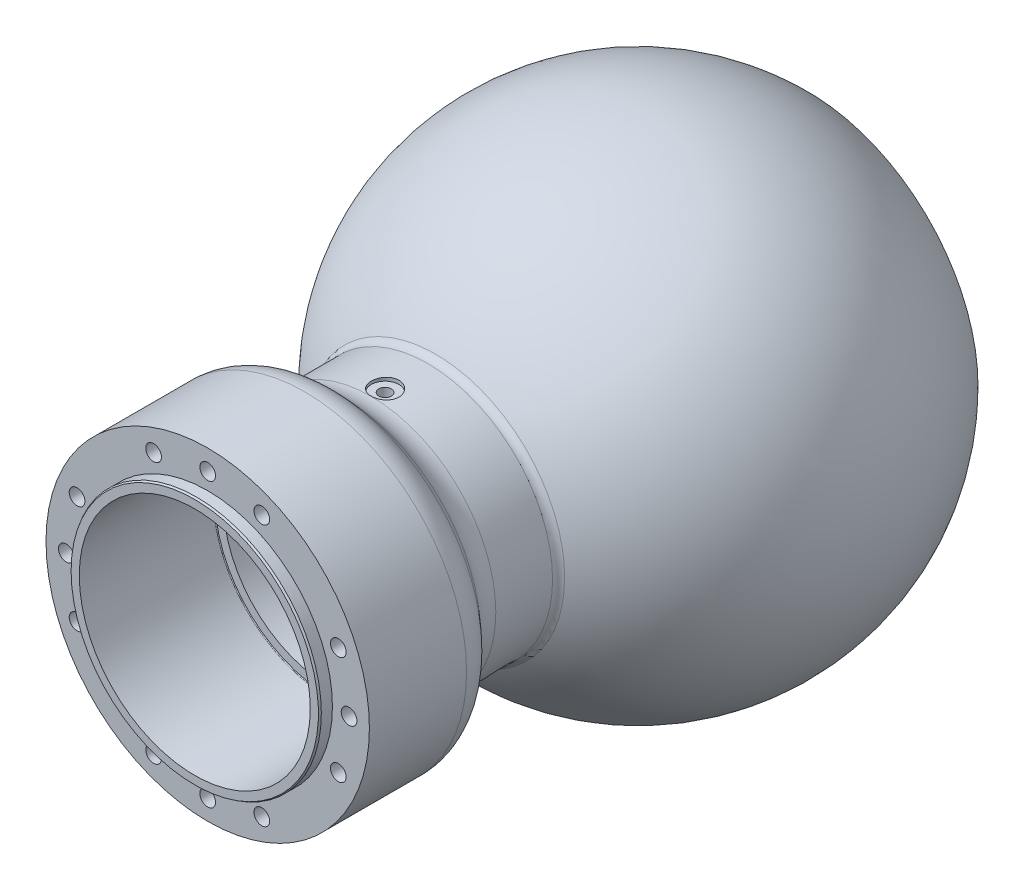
ISO-10303-21;
HEADER;
FILE_DESCRIPTION(('STEP AP214'),'2;1');
FILE_NAME('part.step','',(''),(''),'','','');
FILE_SCHEMA(('AUTOMOTIVE_DESIGN { 1 0 10303 214 1 1 1 1 }'));
ENDSEC;
DATA;
#1=APPLICATION_CONTEXT('core data for automotive mechanical design processes');
#2=APPLICATION_PROTOCOL_DEFINITION('international standard','automotive_design',2000,#1);
#3=PRODUCT_CONTEXT('',#1,'mechanical');
#4=PRODUCT('Part','Part','',(#3));
#5=PRODUCT_RELATED_PRODUCT_CATEGORY('part','',(#4));
#6=PRODUCT_DEFINITION_FORMATION('','',#4);
#7=PRODUCT_DEFINITION_CONTEXT('part definition',#1,'design');
#8=PRODUCT_DEFINITION('design','',#6,#7);
#9=PRODUCT_DEFINITION_SHAPE('','',#8);
#10=(LENGTH_UNIT() NAMED_UNIT(*) SI_UNIT(.MILLI.,.METRE.));
#11=(NAMED_UNIT(*) PLANE_ANGLE_UNIT() SI_UNIT($,.RADIAN.));
#12=(NAMED_UNIT(*) SI_UNIT($,.STERADIAN.) SOLID_ANGLE_UNIT());
#13=UNCERTAINTY_MEASURE_WITH_UNIT(LENGTH_MEASURE(1.E-05),#10,'distance_accuracy_value','');
#14=(GEOMETRIC_REPRESENTATION_CONTEXT(3) GLOBAL_UNCERTAINTY_ASSIGNED_CONTEXT((#13)) GLOBAL_UNIT_ASSIGNED_CONTEXT((#10,
#11,#12)) REPRESENTATION_CONTEXT('',''));
#15=CARTESIAN_POINT('',(0.,0.,0.));
#16=DIRECTION('',(0.,0.,1.));
#17=DIRECTION('',(1.,0.,0.));
#18=AXIS2_PLACEMENT_3D('',#15,#16,#17);
#19=CARTESIAN_POINT('',(0.,62.5,0.));
#20=DIRECTION('',(0.,0.,-1.));
#21=DIRECTION('',(-1.,0.,0.));
#22=AXIS2_PLACEMENT_3D('',#19,#20,#21);
#23=PLANE('',#22);
#24=CARTESIAN_POINT('',(0.,0.,0.));
#25=DIRECTION('',(0.,0.,-1.));
#26=DIRECTION('',(-1.,0.,0.));
#27=AXIS2_PLACEMENT_3D('',#24,#25,#26);
#28=CIRCLE('',#27,66.9226497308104);
#29=CARTESIAN_POINT('',(-66.9226497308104,0.,0.));
#30=VERTEX_POINT('',#29);
#31=EDGE_CURVE('E46',#30,#30,#28,.F.);
#32=ORIENTED_EDGE('',*,*,#31,.T.);
#33=EDGE_LOOP('',(#32));
#34=FACE_BOUND('',#33,.T.);
#35=CARTESIAN_POINT('',(0.,0.,0.));
#36=DIRECTION('',(0.,0.,1.));
#37=DIRECTION('',(1.,0.,0.));
#38=AXIS2_PLACEMENT_3D('',#35,#36,#37);
#39=CIRCLE('',#38,62.5);
#40=CARTESIAN_POINT('',(62.5,0.,0.));
#41=VERTEX_POINT('',#40);
#42=EDGE_CURVE('E202',#41,#41,#39,.T.);
#43=ORIENTED_EDGE('',*,*,#42,.F.);
#44=EDGE_LOOP('',(#43));
#45=FACE_BOUND('',#44,.T.);
#46=ADVANCED_FACE('F38',(#34,#45),#23,.F.);
#47=CARTESIAN_POINT('',(0.,0.,0.));
#48=DIRECTION('',(0.,0.,1.));
#49=DIRECTION('',(1.,0.,0.));
#50=AXIS2_PLACEMENT_3D('',#47,#48,#49);
#51=CYLINDRICAL_SURFACE('',#50,62.5);
#52=CARTESIAN_POINT('',(0.,0.,-72.6));
#53=DIRECTION('',(0.,0.,1.));
#54=DIRECTION('',(1.,0.,0.));
#55=AXIS2_PLACEMENT_3D('',#52,#53,#54);
#56=CIRCLE('',#55,62.5);
#57=CARTESIAN_POINT('',(62.5,0.,-72.6));
#58=VERTEX_POINT('',#57);
#59=EDGE_CURVE('E199',#58,#58,#56,.T.);
#60=ORIENTED_EDGE('',*,*,#59,.F.);
#61=EDGE_LOOP('',(#60));
#62=FACE_BOUND('',#61,.T.);
#63=ORIENTED_EDGE('',*,*,#42,.T.);
#64=EDGE_LOOP('',(#63));
#65=FACE_BOUND('',#64,.T.);
#66=ADVANCED_FACE('F360',(#62,#65),#51,.F.);
#67=CARTESIAN_POINT('',(0.,0.,-72.6));
#68=DIRECTION('',(0.,0.,1.));
#69=DIRECTION('',(1.,0.,0.));
#70=AXIS2_PLACEMENT_3D('',#67,#68,#69);
#71=TOROIDAL_SURFACE('',#70,62.1,0.400000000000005);
#72=CARTESIAN_POINT('',(0.,0.,-73.));
#73=DIRECTION('',(0.,0.,1.));
#74=DIRECTION('',(1.,0.,0.));
#75=AXIS2_PLACEMENT_3D('',#72,#73,#74);
#76=CIRCLE('',#75,62.1);
#77=CARTESIAN_POINT('',(62.1,0.,-73.));
#78=VERTEX_POINT('',#77);
#79=EDGE_CURVE('E196',#78,#78,#76,.T.);
#80=ORIENTED_EDGE('',*,*,#79,.F.);
#81=EDGE_LOOP('',(#80));
#82=FACE_BOUND('',#81,.T.);
#83=ORIENTED_EDGE('',*,*,#59,.T.);
#84=EDGE_LOOP('',(#83));
#85=FACE_BOUND('',#84,.T.);
#86=ADVANCED_FACE('F366',(#82,#85),#71,.F.);
#87=CARTESIAN_POINT('',(0.,62.1,-73.));
#88=DIRECTION('',(0.,0.,-1.));
#89=DIRECTION('',(-1.,0.,0.));
#90=AXIS2_PLACEMENT_3D('',#87,#88,#89);
#91=PLANE('',#90);
#92=CARTESIAN_POINT('',(0.,0.,-73.));
#93=DIRECTION('',(0.,0.,1.));
#94=DIRECTION('',(1.,0.,0.));
#95=AXIS2_PLACEMENT_3D('',#92,#93,#94);
#96=CIRCLE('',#95,57.5);
#97=CARTESIAN_POINT('',(57.5,0.,-73.));
#98=VERTEX_POINT('',#97);
#99=EDGE_CURVE('E193',#98,#98,#96,.T.);
#100=ORIENTED_EDGE('',*,*,#99,.F.);
#101=EDGE_LOOP('',(#100));
#102=FACE_BOUND('',#101,.T.);
#103=ORIENTED_EDGE('',*,*,#79,.T.);
#104=EDGE_LOOP('',(#103));
#105=FACE_BOUND('',#104,.T.);
#106=ADVANCED_FACE('F410',(#102,#105),#91,.F.);
#107=CARTESIAN_POINT('',(0.,0.,0.));
#108=DIRECTION('',(0.,0.,1.));
#109=DIRECTION('',(1.,0.,0.));
#110=AXIS2_PLACEMENT_3D('',#107,#108,#109);
#111=CYLINDRICAL_SURFACE('',#110,57.5);
#112=CARTESIAN_POINT('',(42.9916611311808,-38.1833350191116,-116.));
#113=CARTESIAN_POINT('',(42.9916561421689,-38.1833419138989,-115.809199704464));
#114=CARTESIAN_POINT('',(42.9809461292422,-38.1954099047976,-115.618265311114));
#115=CARTESIAN_POINT('',(42.9383190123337,-38.2433229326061,-115.2416672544));
#116=CARTESIAN_POINT('',(42.9063771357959,-38.2791957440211,-115.056010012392));
#117=CARTESIAN_POINT('',(42.8220393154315,-38.3735185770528,-114.695475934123));
#118=CARTESIAN_POINT('',(42.7696540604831,-38.4319568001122,-114.520593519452));
#119=CARTESIAN_POINT('',(42.6456786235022,-38.5694778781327,-114.18651107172));
#120=CARTESIAN_POINT('',(42.5740928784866,-38.6485559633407,-114.02730742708));
#121=CARTESIAN_POINT('',(42.4133257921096,-38.8249147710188,-113.72883898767));
#122=CARTESIAN_POINT('',(42.3241234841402,-38.9222171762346,-113.589598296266));
#123=CARTESIAN_POINT('',(42.1303543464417,-39.1318741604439,-113.335214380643));
#124=CARTESIAN_POINT('',(42.0257868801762,-39.2442293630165,-113.220072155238));
#125=CARTESIAN_POINT('',(41.8038362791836,-39.4805715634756,-113.017081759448));
#126=CARTESIAN_POINT('',(41.6864440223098,-39.6045668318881,-112.929253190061));
#127=CARTESIAN_POINT('',(41.4419552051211,-39.8603263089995,-112.783508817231));
#128=CARTESIAN_POINT('',(41.314858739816,-39.9920904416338,-112.725592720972));
#129=CARTESIAN_POINT('',(41.0545321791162,-40.2592861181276,-112.641383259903));
#130=CARTESIAN_POINT('',(40.92130950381,-40.394713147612,-112.61505263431));
#131=CARTESIAN_POINT('',(40.6522888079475,-40.6654377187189,-112.594646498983));
#132=CARTESIAN_POINT('',(40.5164908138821,-40.8007352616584,-112.600570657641));
#133=CARTESIAN_POINT('',(40.2463750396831,-41.0672041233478,-112.644475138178));
#134=CARTESIAN_POINT('',(40.1120556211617,-41.1983803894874,-112.682415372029));
#135=CARTESIAN_POINT('',(39.8486634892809,-41.4531979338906,-112.78921282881));
#136=CARTESIAN_POINT('',(39.7195908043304,-41.5768391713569,-112.858070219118));
#137=CARTESIAN_POINT('',(39.4704908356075,-41.8133938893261,-113.024792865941));
#138=CARTESIAN_POINT('',(39.3504692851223,-41.9263005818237,-113.122676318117));
#139=CARTESIAN_POINT('',(39.123246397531,-42.1384122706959,-113.344659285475));
#140=CARTESIAN_POINT('',(39.0160451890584,-42.237617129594,-113.468759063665));
#141=CARTESIAN_POINT('',(38.8176699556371,-42.420003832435,-113.739878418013));
#142=CARTESIAN_POINT('',(38.7265207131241,-42.5031609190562,-113.886932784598));
#143=CARTESIAN_POINT('',(38.5633709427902,-42.6512438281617,-114.199664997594));
#144=CARTESIAN_POINT('',(38.4913704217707,-42.7161696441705,-114.365342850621));
#145=CARTESIAN_POINT('',(38.3688627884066,-42.8262441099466,-114.71064098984));
#146=CARTESIAN_POINT('',(38.318356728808,-42.8713917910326,-114.890261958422));
#147=CARTESIAN_POINT('',(38.240516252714,-42.9408390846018,-115.258337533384));
#148=CARTESIAN_POINT('',(38.2131815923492,-42.9651389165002,-115.446792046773));
#149=CARTESIAN_POINT('',(38.1826209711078,-42.9923002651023,-115.826879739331));
#150=CARTESIAN_POINT('',(38.1793585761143,-42.9951941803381,-116.018507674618));
#151=CARTESIAN_POINT('',(38.1969554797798,-42.9795617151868,-116.399771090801));
#152=CARTESIAN_POINT('',(38.2178146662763,-42.9610354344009,-116.589406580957));
#153=CARTESIAN_POINT('',(38.2829338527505,-42.9030168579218,-116.961164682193));
#154=CARTESIAN_POINT('',(38.3271771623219,-42.8635395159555,-117.143292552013));
#155=CARTESIAN_POINT('',(38.4375910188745,-42.7645538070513,-117.495027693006));
#156=CARTESIAN_POINT('',(38.5037617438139,-42.7050452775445,-117.664634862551));
#157=CARTESIAN_POINT('',(38.6559642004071,-42.567322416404,-117.986737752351));
#158=CARTESIAN_POINT('',(38.7420196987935,-42.4890856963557,-118.139212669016));
#159=CARTESIAN_POINT('',(38.9311832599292,-42.3158289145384,-118.422513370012));
#160=CARTESIAN_POINT('',(39.0342914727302,-42.2208087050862,-118.553338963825));
#161=CARTESIAN_POINT('',(39.2544465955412,-42.0161991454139,-118.789791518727));
#162=CARTESIAN_POINT('',(39.3715106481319,-41.9065918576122,-118.895387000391));
#163=CARTESIAN_POINT('',(39.6158460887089,-41.6756878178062,-119.078166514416));
#164=CARTESIAN_POINT('',(39.7431174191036,-41.5543911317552,-119.155350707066));
#165=CARTESIAN_POINT('',(40.0039188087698,-41.3033798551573,-119.279061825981));
#166=CARTESIAN_POINT('',(40.1374447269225,-41.1736708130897,-119.325608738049));
#167=CARTESIAN_POINT('',(40.4068744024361,-40.9092912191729,-119.386789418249));
#168=CARTESIAN_POINT('',(40.5427781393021,-40.7746207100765,-119.401423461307));
#169=CARTESIAN_POINT('',(40.8128332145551,-40.5043095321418,-119.398360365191));
#170=CARTESIAN_POINT('',(40.9469869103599,-40.3686706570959,-119.380712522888));
#171=CARTESIAN_POINT('',(41.2100065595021,-40.1001333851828,-119.313688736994));
#172=CARTESIAN_POINT('',(41.3388725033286,-39.9672349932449,-119.264312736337));
#173=CARTESIAN_POINT('',(41.587833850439,-39.7081148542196,-119.135245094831));
#174=CARTESIAN_POINT('',(41.7079292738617,-39.5818930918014,-119.055553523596));
#175=CARTESIAN_POINT('',(41.9362122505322,-39.3399517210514,-118.86812412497));
#176=CARTESIAN_POINT('',(42.0444001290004,-39.2242318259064,-118.760387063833));
#177=CARTESIAN_POINT('',(42.2462831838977,-39.0067128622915,-118.519743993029));
#178=CARTESIAN_POINT('',(42.3399576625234,-38.9049336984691,-118.386802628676));
#179=CARTESIAN_POINT('',(42.5103454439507,-38.7186842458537,-118.099566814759));
#180=CARTESIAN_POINT('',(42.5870545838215,-38.6342182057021,-117.94526713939));
#181=CARTESIAN_POINT('',(42.7217114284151,-38.4852633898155,-117.619534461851));
#182=CARTESIAN_POINT('',(42.7796372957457,-38.4207978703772,-117.448081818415));
#183=CARTESIAN_POINT('',(42.8751782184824,-38.3141523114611,-117.09317798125));
#184=CARTESIAN_POINT('',(42.9128171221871,-38.2719461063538,-116.909741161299));
#185=CARTESIAN_POINT('',(42.9571052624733,-38.2222151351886,-116.604314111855));
#186=CARTESIAN_POINT('',(42.9700495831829,-38.2076564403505,-116.484299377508));
#187=CARTESIAN_POINT('',(42.9873291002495,-38.1882141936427,-116.242874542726));
#188=CARTESIAN_POINT('',(42.9916643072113,-38.1833306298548,-116.12146444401));
#189=CARTESIAN_POINT('',(42.9916611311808,-38.1833350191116,-116.));
#190=B_SPLINE_CURVE_WITH_KNOTS('',3,(#112,#113,#114,#115,#116,#117,#118,#119,#120,#121,#122,
#123,#124,#125,#126,#127,#128,#129,#130,#131,#132,#133,#134,#135,#136,#137,#138,#139,#140,#141,
#142,#143,#144,#145,#146,#147,#148,#149,#150,#151,#152,#153,#154,#155,#156,#157,#158,#159,#160,
#161,#162,#163,#164,#165,#166,#167,#168,#169,#170,#171,#172,#173,#174,#175,#176,#177,#178,#179,
#180,#181,#182,#183,#184,#185,#186,#187,#188,#189),.UNSPECIFIED.,.T.,.F.,(4,2,2,2,2,2,2,2,2,2,2,
2,2,2,2,2,2,2,2,2,2,2,2,2,2,2,2,2,2,2,2,2,2,2,2,2,2,2,4),(0.,0.571957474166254,1.14458346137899,
1.71691044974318,2.28910529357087,2.86198529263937,3.4348890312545,4.00820295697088,
4.58151127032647,5.15414259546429,5.72676803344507,6.29867753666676,6.87059013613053,
7.44286201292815,8.01513963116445,8.58829318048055,9.16144693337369,9.73462875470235,
10.3078045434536,10.8801126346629,11.4524180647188,12.024315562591,12.5962177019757,
13.1688069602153,13.7414012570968,14.3147062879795,14.8880080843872,15.4609355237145,
16.0338580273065,16.6059063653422,17.1779557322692,17.7500037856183,18.3220362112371,
18.8948770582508,19.4678583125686,20.0415033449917,20.6144725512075,20.9785840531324,
21.3426951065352),.UNSPECIFIED.);
#191=CARTESIAN_POINT('',(42.9916611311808,-38.1833350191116,-116.));
#192=VERTEX_POINT('',#191);
#193=EDGE_CURVE('E507',#192,#192,#190,.T.);
#194=ORIENTED_EDGE('',*,*,#193,.T.);
#195=EDGE_LOOP('',(#194));
#196=FACE_BOUND('',#195,.T.);
#197=CARTESIAN_POINT('',(-38.1833350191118,-42.9916611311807,-116.));
#198=CARTESIAN_POINT('',(-38.183341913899,-42.9916561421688,-115.809199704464));
#199=CARTESIAN_POINT('',(-38.1954099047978,-42.980946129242,-115.618265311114));
#200=CARTESIAN_POINT('',(-38.2433229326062,-42.9383190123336,-115.2416672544));
#201=CARTESIAN_POINT('',(-38.2791957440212,-42.9063771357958,-115.056010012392));
#202=CARTESIAN_POINT('',(-38.3735185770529,-42.8220393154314,-114.695475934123));
#203=CARTESIAN_POINT('',(-38.4319568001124,-42.7696540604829,-114.520593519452));
#204=CARTESIAN_POINT('',(-38.5694778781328,-42.6456786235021,-114.18651107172));
#205=CARTESIAN_POINT('',(-38.6485559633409,-42.5740928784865,-114.02730742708));
#206=CARTESIAN_POINT('',(-38.8249147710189,-42.4133257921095,-113.72883898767));
#207=CARTESIAN_POINT('',(-38.9222171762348,-42.3241234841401,-113.589598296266));
#208=CARTESIAN_POINT('',(-39.131874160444,-42.1303543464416,-113.335214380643));
#209=CARTESIAN_POINT('',(-39.2442293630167,-42.025786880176,-113.220072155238));
#210=CARTESIAN_POINT('',(-39.4805715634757,-41.8038362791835,-113.017081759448));
#211=CARTESIAN_POINT('',(-39.6045668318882,-41.6864440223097,-112.929253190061));
#212=CARTESIAN_POINT('',(-39.8603263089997,-41.4419552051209,-112.783508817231));
#213=CARTESIAN_POINT('',(-39.992090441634,-41.3148587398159,-112.725592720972));
#214=CARTESIAN_POINT('',(-40.2592861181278,-41.054532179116,-112.641383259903));
#215=CARTESIAN_POINT('',(-40.3947131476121,-40.9213095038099,-112.61505263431));
#216=CARTESIAN_POINT('',(-40.665437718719,-40.6522888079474,-112.594646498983));
#217=CARTESIAN_POINT('',(-40.8007352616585,-40.516490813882,-112.600570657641));
#218=CARTESIAN_POINT('',(-41.0672041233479,-40.2463750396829,-112.644475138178));
#219=CARTESIAN_POINT('',(-41.1983803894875,-40.1120556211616,-112.682415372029));
#220=CARTESIAN_POINT('',(-41.4531979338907,-39.8486634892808,-112.78921282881));
#221=CARTESIAN_POINT('',(-41.5768391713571,-39.7195908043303,-112.858070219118));
#222=CARTESIAN_POINT('',(-41.8133938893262,-39.4704908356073,-113.024792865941));
#223=CARTESIAN_POINT('',(-41.9263005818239,-39.3504692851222,-113.122676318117));
#224=CARTESIAN_POINT('',(-42.1384122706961,-39.1232463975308,-113.344659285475));
#225=CARTESIAN_POINT('',(-42.2376171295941,-39.0160451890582,-113.468759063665));
#226=CARTESIAN_POINT('',(-42.4200038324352,-38.8176699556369,-113.739878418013));
#227=CARTESIAN_POINT('',(-42.5031609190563,-38.7265207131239,-113.886932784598));
#228=CARTESIAN_POINT('',(-42.6512438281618,-38.5633709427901,-114.199664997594));
#229=CARTESIAN_POINT('',(-42.7161696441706,-38.4913704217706,-114.365342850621));
#230=CARTESIAN_POINT('',(-42.8262441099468,-38.3688627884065,-114.71064098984));
#231=CARTESIAN_POINT('',(-42.8713917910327,-38.3183567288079,-114.890261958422));
#232=CARTESIAN_POINT('',(-42.940839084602,-38.2405162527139,-115.258337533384));
#233=CARTESIAN_POINT('',(-42.9651389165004,-38.2131815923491,-115.446792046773));
#234=CARTESIAN_POINT('',(-42.9923002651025,-38.1826209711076,-115.826879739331));
#235=CARTESIAN_POINT('',(-42.9951941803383,-38.1793585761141,-116.018507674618));
#236=CARTESIAN_POINT('',(-42.9795617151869,-38.1969554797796,-116.399771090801));
#237=CARTESIAN_POINT('',(-42.961035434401,-38.2178146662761,-116.589406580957));
#238=CARTESIAN_POINT('',(-42.9030168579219,-38.2829338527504,-116.961164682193));
#239=CARTESIAN_POINT('',(-42.8635395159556,-38.3271771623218,-117.143292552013));
#240=CARTESIAN_POINT('',(-42.7645538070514,-38.4375910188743,-117.495027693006));
#241=CARTESIAN_POINT('',(-42.7050452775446,-38.5037617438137,-117.664634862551));
#242=CARTESIAN_POINT('',(-42.5673224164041,-38.655964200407,-117.986737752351));
#243=CARTESIAN_POINT('',(-42.4890856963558,-38.7420196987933,-118.139212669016));
#244=CARTESIAN_POINT('',(-42.3158289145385,-38.931183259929,-118.422513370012));
#245=CARTESIAN_POINT('',(-42.2208087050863,-39.03429147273,-118.553338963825));
#246=CARTESIAN_POINT('',(-42.016199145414,-39.254446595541,-118.789791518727));
#247=CARTESIAN_POINT('',(-41.9065918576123,-39.3715106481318,-118.895387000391));
#248=CARTESIAN_POINT('',(-41.6756878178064,-39.6158460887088,-119.078166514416));
#249=CARTESIAN_POINT('',(-41.5543911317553,-39.7431174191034,-119.155350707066));
#250=CARTESIAN_POINT('',(-41.3033798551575,-40.0039188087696,-119.279061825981));
#251=CARTESIAN_POINT('',(-41.1736708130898,-40.1374447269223,-119.325608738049));
#252=CARTESIAN_POINT('',(-40.909291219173,-40.4068744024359,-119.386789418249));
#253=CARTESIAN_POINT('',(-40.7746207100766,-40.5427781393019,-119.401423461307));
#254=CARTESIAN_POINT('',(-40.5043095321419,-40.812833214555,-119.398360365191));
#255=CARTESIAN_POINT('',(-40.3686706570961,-40.9469869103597,-119.380712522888));
#256=CARTESIAN_POINT('',(-40.1001333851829,-41.210006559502,-119.313688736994));
#257=CARTESIAN_POINT('',(-39.9672349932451,-41.3388725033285,-119.264312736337));
#258=CARTESIAN_POINT('',(-39.7081148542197,-41.5878338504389,-119.135245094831));
#259=CARTESIAN_POINT('',(-39.5818930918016,-41.7079292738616,-119.055553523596));
#260=CARTESIAN_POINT('',(-39.3399517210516,-41.9362122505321,-118.86812412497));
#261=CARTESIAN_POINT('',(-39.2242318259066,-42.0444001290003,-118.760387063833));
#262=CARTESIAN_POINT('',(-39.0067128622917,-42.2462831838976,-118.519743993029));
#263=CARTESIAN_POINT('',(-38.9049336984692,-42.3399576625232,-118.386802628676));
#264=CARTESIAN_POINT('',(-38.7186842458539,-42.5103454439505,-118.099566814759));
#265=CARTESIAN_POINT('',(-38.6342182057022,-42.5870545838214,-117.94526713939));
#266=CARTESIAN_POINT('',(-38.4852633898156,-42.721711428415,-117.619534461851));
#267=CARTESIAN_POINT('',(-38.4207978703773,-42.7796372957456,-117.448081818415));
#268=CARTESIAN_POINT('',(-38.3141523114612,-42.8751782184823,-117.09317798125));
#269=CARTESIAN_POINT('',(-38.2719461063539,-42.9128171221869,-116.909741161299));
#270=CARTESIAN_POINT('',(-38.2222151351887,-42.9571052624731,-116.604314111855));
#271=CARTESIAN_POINT('',(-38.2076564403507,-42.9700495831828,-116.484299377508));
#272=CARTESIAN_POINT('',(-38.1882141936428,-42.9873291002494,-116.242874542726));
#273=CARTESIAN_POINT('',(-38.1833306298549,-42.9916643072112,-116.12146444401));
#274=CARTESIAN_POINT('',(-38.1833350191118,-42.9916611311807,-116.));
#275=B_SPLINE_CURVE_WITH_KNOTS('',3,(#197,#198,#199,#200,#201,#202,#203,#204,#205,#206,#207,
#208,#209,#210,#211,#212,#213,#214,#215,#216,#217,#218,#219,#220,#221,#222,#223,#224,#225,#226,
#227,#228,#229,#230,#231,#232,#233,#234,#235,#236,#237,#238,#239,#240,#241,#242,#243,#244,#245,
#246,#247,#248,#249,#250,#251,#252,#253,#254,#255,#256,#257,#258,#259,#260,#261,#262,#263,#264,
#265,#266,#267,#268,#269,#270,#271,#272,#273,#274),.UNSPECIFIED.,.T.,.F.,(4,2,2,2,2,2,2,2,2,2,2,
2,2,2,2,2,2,2,2,2,2,2,2,2,2,2,2,2,2,2,2,2,2,2,2,2,2,2,4),(0.,0.571957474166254,1.14458346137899,
1.71691044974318,2.28910529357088,2.86198529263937,3.4348890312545,4.00820295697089,
4.58151127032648,5.1541425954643,5.72676803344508,6.29867753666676,6.87059013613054,
7.44286201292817,8.01513963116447,8.58829318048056,9.16144693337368,9.73462875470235,
10.3078045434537,10.8801126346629,11.4524180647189,12.0243155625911,12.5962177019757,
13.1688069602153,13.7414012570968,14.3147062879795,14.8880080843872,15.4609355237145,
16.0338580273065,16.6059063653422,17.1779557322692,17.7500037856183,18.3220362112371,
18.8948770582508,19.4678583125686,20.0415033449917,20.6144725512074,20.9785840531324,
21.3426951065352),.UNSPECIFIED.);
#276=CARTESIAN_POINT('',(-38.1833350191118,-42.9916611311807,-116.));
#277=VERTEX_POINT('',#276);
#278=EDGE_CURVE('E424',#277,#277,#275,.T.);
#279=ORIENTED_EDGE('',*,*,#278,.T.);
#280=EDGE_LOOP('',(#279));
#281=FACE_BOUND('',#280,.T.);
#282=CARTESIAN_POINT('',(0.,57.5,-99.6));
#283=CARTESIAN_POINT('',(0.19080062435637,57.4999986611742,-99.6000084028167));
#284=CARTESIAN_POINT('',(0.381735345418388,57.4990401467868,-99.6161149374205));
#285=CARTESIAN_POINT('',(0.758334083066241,57.4953085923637,-99.6801367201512));
#286=CARTESIAN_POINT('',(0.943991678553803,57.492533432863,-99.728089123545));
#287=CARTESIAN_POINT('',(1.30452650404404,57.4854825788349,-99.8544218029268));
#288=CARTESIAN_POINT('',(1.47940930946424,57.4812076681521,-99.9327861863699));
#289=CARTESIAN_POINT('',(1.8134924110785,57.4716383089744,-100.117692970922));
#290=CARTESIAN_POINT('',(1.9726963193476,57.4663440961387,-100.224228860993));
#291=CARTESIAN_POINT('',(2.2711644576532,57.4553233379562,-100.462613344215));
#292=CARTESIAN_POINT('',(2.41040466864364,57.4495962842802,-100.594491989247));
#293=CARTESIAN_POINT('',(2.66478765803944,57.438359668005,-100.879756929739));
#294=CARTESIAN_POINT('',(2.77992943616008,57.4328501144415,-101.033144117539));
#295=CARTESIAN_POINT('',(2.98291936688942,57.4226659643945,-101.35720580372));
#296=CARTESIAN_POINT('',(3.07074783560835,57.4179919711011,-101.527892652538));
#297=CARTESIAN_POINT('',(3.21649199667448,57.410012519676,-101.881621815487));
#298=CARTESIAN_POINT('',(3.27440798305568,57.4067070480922,-102.064664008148));
#299=CARTESIAN_POINT('',(3.3586172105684,57.4018421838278,-102.437678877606));
#300=CARTESIAN_POINT('',(3.38494770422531,57.4002807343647,-102.627643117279));
#301=CARTESIAN_POINT('',(3.40535350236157,57.3990738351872,-103.009301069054));
#302=CARTESIAN_POINT('',(3.39942913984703,57.3994283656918,-103.20099476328));
#303=CARTESIAN_POINT('',(3.35552433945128,57.4020115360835,-103.580416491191));
#304=CARTESIAN_POINT('',(3.31758419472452,57.4042378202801,-103.768149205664));
#305=CARTESIAN_POINT('',(3.21078729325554,57.4103098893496,-104.134576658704));
#306=CARTESIAN_POINT('',(3.14193036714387,57.4141556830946,-104.313271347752));
#307=CARTESIAN_POINT('',(2.97520867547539,57.4230360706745,-104.656679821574));
#308=CARTESIAN_POINT('',(2.87732560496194,57.4280714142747,-104.821384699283));
#309=CARTESIAN_POINT('',(2.65534344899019,57.4387626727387,-105.132040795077));
#310=CARTESIAN_POINT('',(2.5312441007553,57.4444185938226,-105.277991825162));
#311=CARTESIAN_POINT('',(2.26012504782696,57.4557240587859,-105.547231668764));
#312=CARTESIAN_POINT('',(2.1130704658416,57.4613735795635,-105.670485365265));
#313=CARTESIAN_POINT('',(1.80033764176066,57.4720212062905,-105.890561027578));
#314=CARTESIAN_POINT('',(1.63465939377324,57.4770193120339,-105.987382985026));
#315=CARTESIAN_POINT('',(1.28936115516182,57.4858012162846,-106.151843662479));
#316=CARTESIAN_POINT('',(1.10974054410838,57.4895849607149,-106.219481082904));
#317=CARTESIAN_POINT('',(0.741665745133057,57.4955110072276,-106.323629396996));
#318=CARTESIAN_POINT('',(0.553211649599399,57.4976533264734,-106.36014061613));
#319=CARTESIAN_POINT('',(0.173124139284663,57.5000528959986,-106.400956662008));
#320=CARTESIAN_POINT('',(-0.0185040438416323,57.500312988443,-106.405310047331));
#321=CARTESIAN_POINT('',(-0.399768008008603,57.4989263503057,-106.38181368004));
#322=CARTESIAN_POINT('',(-0.589403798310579,57.4972796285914,-106.353964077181));
#323=CARTESIAN_POINT('',(-0.961163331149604,57.49226659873,-106.2668924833));
#324=CARTESIAN_POINT('',(-1.14329230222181,57.4889015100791,-106.207692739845));
#325=CARTESIAN_POINT('',(-1.49502951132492,57.4808304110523,-106.059623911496));
#326=CARTESIAN_POINT('',(-1.66463764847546,57.476124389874,-105.970754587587));
#327=CARTESIAN_POINT('',(-1.98674117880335,57.4658933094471,-105.765745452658));
#328=CARTESIAN_POINT('',(-2.13921587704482,57.4603672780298,-105.649573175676));
#329=CARTESIAN_POINT('',(-2.42251607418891,57.449121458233,-105.39330314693));
#330=CARTESIAN_POINT('',(-2.55334138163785,57.4434016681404,-105.253205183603));
#331=CARTESIAN_POINT('',(-2.78979334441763,57.4324047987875,-104.952851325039));
#332=CARTESIAN_POINT('',(-2.8953885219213,57.4271282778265,-104.79257062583));
#333=CARTESIAN_POINT('',(-3.07816750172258,57.4176218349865,-104.456525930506));
#334=CARTESIAN_POINT('',(-3.15535146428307,57.4133919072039,-104.280762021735));
#335=CARTESIAN_POINT('',(-3.27906242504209,57.4064596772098,-103.918855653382));
#336=CARTESIAN_POINT('',(-3.32560930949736,57.4037563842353,-103.732720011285));
#337=CARTESIAN_POINT('',(-3.38678979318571,57.4001795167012,-103.355258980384));
#338=CARTESIAN_POINT('',(-3.40142366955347,57.3993059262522,-103.163933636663));
#339=CARTESIAN_POINT('',(-3.39836009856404,57.3994873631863,-102.781837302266));
#340=CARTESIAN_POINT('',(-3.38071214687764,57.4005394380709,-102.591065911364));
#341=CARTESIAN_POINT('',(-3.3136884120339,57.4044473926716,-102.215199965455));
#342=CARTESIAN_POINT('',(-3.2643125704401,57.4073032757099,-102.030105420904));
#343=CARTESIAN_POINT('',(-3.13524553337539,57.4144962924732,-101.670839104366));
#344=CARTESIAN_POINT('',(-3.05555440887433,57.4188334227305,-101.496667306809));
#345=CARTESIAN_POINT('',(-2.86812613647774,57.4285000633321,-101.164169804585));
#346=CARTESIAN_POINT('',(-2.76038975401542,57.4338295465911,-101.005843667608));
#347=CARTESIAN_POINT('',(-2.51974741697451,57.4448897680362,-100.709281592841));
#348=CARTESIAN_POINT('',(-2.38680595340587,57.4506210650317,-100.571074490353));
#349=CARTESIAN_POINT('',(-2.0995697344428,57.4618344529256,-100.318892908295));
#350=CARTESIAN_POINT('',(-1.94526975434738,57.4673164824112,-100.204924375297));
#351=CARTESIAN_POINT('',(-1.61953684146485,57.477418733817,-100.00438015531));
#352=CARTESIAN_POINT('',(-1.44808432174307,57.4820379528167,-99.917836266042));
#353=CARTESIAN_POINT('',(-1.09318074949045,57.4898802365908,-99.7748685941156));
#354=CARTESIAN_POINT('',(-0.909744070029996,57.4931049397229,-99.7184094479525));
#355=CARTESIAN_POINT('',(-0.604316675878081,57.4969474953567,-99.6519275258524));
#356=CARTESIAN_POINT('',(-0.484301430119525,57.4980871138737,-99.6324797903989));
#357=CARTESIAN_POINT('',(-0.242875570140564,57.4996137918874,-99.6065133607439));
#358=CARTESIAN_POINT('',(-0.121464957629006,57.5000008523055,-99.5999946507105));
#359=CARTESIAN_POINT('',(0.,57.5,-99.6));
#360=B_SPLINE_CURVE_WITH_KNOTS('',3,(#282,#283,#284,#285,#286,#287,#288,#289,#290,#291,#292,
#293,#294,#295,#296,#297,#298,#299,#300,#301,#302,#303,#304,#305,#306,#307,#308,#309,#310,#311,
#312,#313,#314,#315,#316,#317,#318,#319,#320,#321,#322,#323,#324,#325,#326,#327,#328,#329,#330,
#331,#332,#333,#334,#335,#336,#337,#338,#339,#340,#341,#342,#343,#344,#345,#346,#347,#348,#349,
#350,#351,#352,#353,#354,#355,#356,#357,#358,#359),.UNSPECIFIED.,.T.,.F.,(4,2,2,2,2,2,2,2,2,2,2,
2,2,2,2,2,2,2,2,2,2,2,2,2,2,2,2,2,2,2,2,2,2,2,2,2,2,2,4),(0.,0.571958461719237,1.14458541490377,
1.71691352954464,2.28910948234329,2.86198818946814,3.43489067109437,4.00820507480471,
4.58151384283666,5.15414577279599,5.7267717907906,6.29867820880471,6.87058775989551,
7.44285874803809,8.01513547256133,8.58829031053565,9.16144532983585,9.73462586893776,
10.3078004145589,10.8801092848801,11.4524154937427,12.024316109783,12.5962213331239,
13.1688100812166,13.7414038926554,14.3147084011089,14.8880096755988,15.4609384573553,
16.0338622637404,16.6059083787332,17.1779555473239,17.7500013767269,18.3220315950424,
18.8948737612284,19.4678563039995,20.0415007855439,20.614469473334,20.9785825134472,
21.3426951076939),.UNSPECIFIED.);
#361=CARTESIAN_POINT('',(0.,57.5,-99.6));
#362=VERTEX_POINT('',#361);
#363=EDGE_CURVE('E418',#362,#362,#360,.T.);
#364=ORIENTED_EDGE('',*,*,#363,.T.);
#365=EDGE_LOOP('',(#364));
#366=FACE_BOUND('',#365,.T.);
#367=CARTESIAN_POINT('',(0.,0.,-131.74913395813));
#368=DIRECTION('',(0.,0.,-1.));
#369=DIRECTION('',(-1.,0.,0.));
#370=AXIS2_PLACEMENT_3D('',#367,#368,#369);
#371=CIRCLE('',#370,57.5);
#372=CARTESIAN_POINT('',(-57.5,0.,-131.74913395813));
#373=VERTEX_POINT('',#372);
#374=EDGE_CURVE('E208',#373,#373,#371,.T.);
#375=ORIENTED_EDGE('',*,*,#374,.T.);
#376=EDGE_LOOP('',(#375));
#377=FACE_BOUND('',#376,.T.);
#378=ORIENTED_EDGE('',*,*,#99,.T.);
#379=EDGE_LOOP('',(#378));
#380=FACE_BOUND('',#379,.T.);
#381=ADVANCED_FACE('F404',(#196,#281,#366,#377,#380),#111,.F.);
#382=CARTESIAN_POINT('',(0.,0.,-240.));
#383=DIRECTION('',(0.,0.,1.));
#384=DIRECTION('',(1.,0.,0.));
#385=AXIS2_PLACEMENT_3D('',#382,#383,#384);
#386=DEGENERATE_TOROIDAL_SURFACE('',#385,0.00399988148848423,120.,.F.);
#387=CARTESIAN_POINT('',(0.,0.,-136.079168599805));
#388=DIRECTION('',(0.,0.,-1.));
#389=DIRECTION('',(-1.,0.,0.));
#390=AXIS2_PLACEMENT_3D('',#387,#388,#389);
#391=CIRCLE('',#390,59.9998400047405);
#392=CARTESIAN_POINT('',(-59.9998400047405,0.,-136.079168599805));
#393=VERTEX_POINT('',#392);
#394=EDGE_CURVE('E205',#393,#393,#391,.F.);
#395=ORIENTED_EDGE('',*,*,#394,.T.);
#396=EDGE_LOOP('',(#395));
#397=FACE_BOUND('',#396,.T.);
#398=CARTESIAN_POINT('',(0.,0.,-319.368003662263));
#399=DIRECTION('',(0.,0.,1.));
#400=DIRECTION('',(1.,0.,0.));
#401=AXIS2_PLACEMENT_3D('',#398,#399,#400);
#402=CIRCLE('',#401,90.);
#403=CARTESIAN_POINT('',(90.,0.,-319.368003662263));
#404=VERTEX_POINT('',#403);
#405=EDGE_CURVE('E190',#404,#404,#402,.T.);
#406=ORIENTED_EDGE('',*,*,#405,.F.);
#407=EDGE_LOOP('',(#406));
#408=FACE_BOUND('',#407,.T.);
#409=ADVANCED_FACE('F399',(#397,#408),#386,.T.);
#410=CARTESIAN_POINT('',(0.,0.,0.));
#411=DIRECTION('',(0.,0.,1.));
#412=DIRECTION('',(1.,0.,0.));
#413=AXIS2_PLACEMENT_3D('',#410,#411,#412);
#414=CYLINDRICAL_SURFACE('',#413,90.);
#415=CARTESIAN_POINT('',(0.,0.,-332.));
#416=DIRECTION('',(0.,0.,1.));
#417=DIRECTION('',(1.,0.,0.));
#418=AXIS2_PLACEMENT_3D('',#415,#416,#417);
#419=CIRCLE('',#418,90.);
#420=CARTESIAN_POINT('',(90.,0.,-332.));
#421=VERTEX_POINT('',#420);
#422=EDGE_CURVE('E187',#421,#421,#419,.T.);
#423=ORIENTED_EDGE('',*,*,#422,.F.);
#424=EDGE_LOOP('',(#423));
#425=FACE_BOUND('',#424,.T.);
#426=ORIENTED_EDGE('',*,*,#405,.T.);
#427=EDGE_LOOP('',(#426));
#428=FACE_BOUND('',#427,.T.);
#429=ADVANCED_FACE('F393',(#425,#428),#414,.F.);
#430=CARTESIAN_POINT('',(0.,91.8437001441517,-332.));
#431=DIRECTION('',(0.,0.,1.));
#432=DIRECTION('',(1.,0.,0.));
#433=AXIS2_PLACEMENT_3D('',#430,#431,#432);
#434=PLANE('',#433);
#435=CARTESIAN_POINT('',(0.,0.,-332.));
#436=DIRECTION('',(0.,0.,1.));
#437=DIRECTION('',(1.,0.,0.));
#438=AXIS2_PLACEMENT_3D('',#435,#436,#437);
#439=CIRCLE('',#438,91.8437001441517);
#440=CARTESIAN_POINT('',(91.8437001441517,0.,-332.));
#441=VERTEX_POINT('',#440);
#442=EDGE_CURVE('E184',#441,#441,#439,.T.);
#443=ORIENTED_EDGE('',*,*,#442,.F.);
#444=EDGE_LOOP('',(#443));
#445=FACE_BOUND('',#444,.T.);
#446=ORIENTED_EDGE('',*,*,#422,.T.);
#447=EDGE_LOOP('',(#446));
#448=FACE_BOUND('',#447,.T.);
#449=ADVANCED_FACE('F388',(#445,#448),#434,.F.);
#450=CARTESIAN_POINT('',(0.,0.,-240.));
#451=DIRECTION('',(0.,0.,1.));
#452=DIRECTION('',(1.,0.,0.));
#453=AXIS2_PLACEMENT_3D('',#450,#451,#452);
#454=DEGENERATE_TOROIDAL_SURFACE('',#453,0.00399988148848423,130.,.F.);
#455=CARTESIAN_POINT('',(0.,0.,-130.339825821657));
#456=DIRECTION('',(0.,0.,-1.));
#457=DIRECTION('',(-1.,0.,0.));
#458=AXIS2_PLACEMENT_3D('',#455,#456,#457);
#459=CIRCLE('',#458,69.814666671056);
#460=CARTESIAN_POINT('',(-69.814666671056,0.,-130.339825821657));
#461=VERTEX_POINT('',#460);
#462=EDGE_CURVE('E214',#461,#461,#459,.T.);
#463=ORIENTED_EDGE('',*,*,#462,.T.);
#464=EDGE_LOOP('',(#463));
#465=FACE_BOUND('',#464,.T.);
#466=ORIENTED_EDGE('',*,*,#442,.T.);
#467=EDGE_LOOP('',(#466));
#468=FACE_BOUND('',#467,.T.);
#469=ADVANCED_FACE('F355',(#465,#468),#454,.F.);
#470=CARTESIAN_POINT('',(0.,0.,0.));
#471=DIRECTION('',(0.,0.,1.));
#472=DIRECTION('',(1.,0.,0.));
#473=AXIS2_PLACEMENT_3D('',#470,#471,#472);
#474=CYLINDRICAL_SURFACE('',#473,67.5);
#475=CARTESIAN_POINT('',(52.7374657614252,-42.1308640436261,-116.));
#476=CARTESIAN_POINT('',(52.7374668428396,-42.1308620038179,-116.210014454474));
#477=CARTESIAN_POINT('',(52.7319247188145,-42.1378026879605,-116.419995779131));
#478=CARTESIAN_POINT('',(52.7097823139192,-42.1654974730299,-116.838526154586));
#479=CARTESIAN_POINT('',(52.6931794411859,-42.1862548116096,-117.047074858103));
#480=CARTESIAN_POINT('',(52.6489727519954,-42.2414122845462,-117.461342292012));
#481=CARTESIAN_POINT('',(52.621360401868,-42.2758230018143,-117.667058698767));
#482=CARTESIAN_POINT('',(52.5552535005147,-42.3579757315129,-118.074113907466));
#483=CARTESIAN_POINT('',(52.5167549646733,-42.4057226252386,-118.275451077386));
#484=CARTESIAN_POINT('',(52.429106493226,-42.514040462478,-118.672042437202));
#485=CARTESIAN_POINT('',(52.3799673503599,-42.5745984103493,-118.867302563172));
#486=CARTESIAN_POINT('',(52.2712281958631,-42.7080332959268,-119.250651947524));
#487=CARTESIAN_POINT('',(52.2116243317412,-42.7809147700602,-119.438738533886));
#488=CARTESIAN_POINT('',(52.0822898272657,-42.938274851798,-119.806246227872));
#489=CARTESIAN_POINT('',(52.0125648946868,-43.0227469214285,-119.985672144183));
#490=CARTESIAN_POINT('',(51.8632729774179,-43.2025991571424,-120.334788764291));
#491=CARTESIAN_POINT('',(51.7837023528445,-43.297983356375,-120.504475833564));
#492=CARTESIAN_POINT('',(51.6148270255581,-43.4991601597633,-120.833457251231));
#493=CARTESIAN_POINT('',(51.5254882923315,-43.6049890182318,-120.99271196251));
#494=CARTESIAN_POINT('',(51.3377303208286,-43.825888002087,-121.299101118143));
#495=CARTESIAN_POINT('',(51.2393077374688,-43.9409615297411,-121.446231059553));
#496=CARTESIAN_POINT('',(51.0339553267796,-44.1792952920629,-121.727228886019));
#497=CARTESIAN_POINT('',(50.9270282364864,-44.302552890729,-121.861101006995));
#498=CARTESIAN_POINT('',(50.7051724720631,-44.5563002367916,-122.114741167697));
#499=CARTESIAN_POINT('',(50.5902408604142,-44.6867926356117,-122.234503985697));
#500=CARTESIAN_POINT('',(50.3527635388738,-44.9542128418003,-122.459290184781));
#501=CARTESIAN_POINT('',(50.2302000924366,-45.0911554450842,-122.564277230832));
#502=CARTESIAN_POINT('',(49.9784208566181,-45.3700643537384,-122.75841339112));
#503=CARTESIAN_POINT('',(49.8492049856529,-45.5120307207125,-122.847562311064));
#504=CARTESIAN_POINT('',(49.5849078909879,-45.7998370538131,-123.009369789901));
#505=CARTESIAN_POINT('',(49.4498269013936,-45.9456768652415,-123.082029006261));
#506=CARTESIAN_POINT('',(49.1746407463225,-46.2400833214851,-123.21032990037));
#507=CARTESIAN_POINT('',(49.0345354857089,-46.3886500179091,-123.265971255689));
#508=CARTESIAN_POINT('',(48.7508333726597,-46.6867046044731,-123.359618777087));
#509=CARTESIAN_POINT('',(48.6072542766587,-46.8361857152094,-123.397700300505));
#510=CARTESIAN_POINT('',(48.3169400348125,-47.1356215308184,-123.456312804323));
#511=CARTESIAN_POINT('',(48.1702038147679,-47.2855763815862,-123.476837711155));
#512=CARTESIAN_POINT('',(47.8746849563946,-47.5847527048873,-123.500151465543));
#513=CARTESIAN_POINT('',(47.7259031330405,-47.7339744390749,-123.502947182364));
#514=CARTESIAN_POINT('',(47.427298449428,-48.0306757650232,-123.490820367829));
#515=CARTESIAN_POINT('',(47.2774752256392,-48.1781546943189,-123.475891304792));
#516=CARTESIAN_POINT('',(46.8295222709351,-48.6150011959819,-123.404811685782));
#517=CARTESIAN_POINT('',(46.5312663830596,-48.9004406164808,-123.322495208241));
#518=CARTESIAN_POINT('',(45.9441316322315,-49.4524991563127,-123.090250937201));
#519=CARTESIAN_POINT('',(45.6552529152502,-49.7191179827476,-122.940322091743));
#520=CARTESIAN_POINT('',(45.0950746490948,-50.2277581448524,-122.576768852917));
#521=CARTESIAN_POINT('',(44.8238142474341,-50.4697253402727,-122.36300815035));
#522=CARTESIAN_POINT('',(44.3083629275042,-50.9228532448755,-121.877959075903));
#523=CARTESIAN_POINT('',(44.0641729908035,-51.1340128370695,-121.606668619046));
#524=CARTESIAN_POINT('',(43.6097674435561,-51.5221130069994,-121.012515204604));
#525=CARTESIAN_POINT('',(43.3997424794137,-51.6988625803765,-120.689381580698));
#526=CARTESIAN_POINT('',(43.0226040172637,-52.0131329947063,-120.001649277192));
#527=CARTESIAN_POINT('',(42.8554906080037,-52.1506537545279,-119.637050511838));
#528=CARTESIAN_POINT('',(42.5701685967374,-52.3838226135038,-118.876516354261));
#529=CARTESIAN_POINT('',(42.4519742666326,-52.4794584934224,-118.480571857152));
#530=CARTESIAN_POINT('',(42.2689821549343,-52.6269615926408,-117.668697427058));
#531=CARTESIAN_POINT('',(42.2041823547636,-52.6788304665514,-117.252768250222));
#532=CARTESIAN_POINT('',(42.1306477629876,-52.7376598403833,-116.415106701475));
#533=CARTESIAN_POINT('',(42.1216157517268,-52.7448584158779,-115.99341711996));
#534=CARTESIAN_POINT('',(42.1591694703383,-52.7148459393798,-115.154120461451));
#535=CARTESIAN_POINT('',(42.2057542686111,-52.67763563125,-114.736513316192));
#536=CARTESIAN_POINT('',(42.3525692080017,-52.559667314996,-113.918355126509));
#537=CARTESIAN_POINT('',(42.4526582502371,-52.4790238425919,-113.517762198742));
#538=CARTESIAN_POINT('',(42.7026922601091,-52.2757673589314,-112.743687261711));
#539=CARTESIAN_POINT('',(42.8526386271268,-52.1531531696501,-112.370206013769));
#540=CARTESIAN_POINT('',(43.1976671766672,-51.8677335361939,-111.659278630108));
#541=CARTESIAN_POINT('',(43.3929359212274,-51.7047617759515,-111.321990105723));
#542=CARTESIAN_POINT('',(43.8216022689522,-51.3419476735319,-110.694464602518));
#543=CARTESIAN_POINT('',(44.0550010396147,-51.1421042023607,-110.404229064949));
#544=CARTESIAN_POINT('',(44.4279552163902,-50.8176571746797,-110.009953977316));
#545=CARTESIAN_POINT('',(44.5564682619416,-50.7050501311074,-109.885088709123));
#546=CARTESIAN_POINT('',(44.8199824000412,-50.4722697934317,-109.650171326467));
#547=CARTESIAN_POINT('',(44.9549810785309,-50.3520993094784,-109.540113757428));
#548=CARTESIAN_POINT('',(45.2304125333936,-50.1048306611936,-109.335566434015));
#549=CARTESIAN_POINT('',(45.3708471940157,-49.9777300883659,-109.241082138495));
#550=CARTESIAN_POINT('',(45.6559291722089,-49.7174352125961,-109.068427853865));
#551=CARTESIAN_POINT('',(45.8005749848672,-49.5842430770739,-108.990252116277));
#552=CARTESIAN_POINT('',(46.0926816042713,-49.3128215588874,-108.850887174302));
#553=CARTESIAN_POINT('',(46.2401362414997,-49.1746027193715,-108.789664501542));
#554=CARTESIAN_POINT('',(46.5369874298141,-48.8937679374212,-108.684449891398));
#555=CARTESIAN_POINT('',(46.6863839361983,-48.7511520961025,-108.640457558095));
#556=CARTESIAN_POINT('',(46.985977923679,-48.4624715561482,-108.570028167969));
#557=CARTESIAN_POINT('',(47.1361753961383,-48.3164068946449,-108.543590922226));
#558=CARTESIAN_POINT('',(47.4362463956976,-48.0218359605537,-108.508468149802));
#559=CARTESIAN_POINT('',(47.5861199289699,-47.8733297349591,-108.49978228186));
#560=CARTESIAN_POINT('',(47.8836733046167,-47.575706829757,-108.500224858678));
#561=CARTESIAN_POINT('',(48.0313605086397,-47.4265973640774,-108.509260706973));
#562=CARTESIAN_POINT('',(48.3242451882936,-47.1281341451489,-108.544889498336));
#563=CARTESIAN_POINT('',(48.4694435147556,-46.9787804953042,-108.571476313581));
#564=CARTESIAN_POINT('',(48.7564406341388,-46.6808556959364,-108.642011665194));
#565=CARTESIAN_POINT('',(48.898238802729,-46.5322846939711,-108.685963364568));
#566=CARTESIAN_POINT('',(49.1774718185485,-46.2370797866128,-108.790905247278));
#567=CARTESIAN_POINT('',(49.3149067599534,-46.0904458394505,-108.851895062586));
#568=CARTESIAN_POINT('',(49.5845169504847,-45.8002718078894,-108.990456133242));
#569=CARTESIAN_POINT('',(49.7166932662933,-45.6567310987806,-109.068024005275));
#570=CARTESIAN_POINT('',(49.9750076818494,-45.3738393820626,-109.239189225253));
#571=CARTESIAN_POINT('',(50.1011458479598,-45.2344883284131,-109.332786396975));
#572=CARTESIAN_POINT('',(50.346667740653,-44.9610589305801,-109.5353623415));
#573=CARTESIAN_POINT('',(50.4660502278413,-44.8269815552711,-109.644343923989));
#574=CARTESIAN_POINT('',(50.6973194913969,-44.5652587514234,-109.876863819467));
#575=CARTESIAN_POINT('',(50.8092089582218,-44.4376110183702,-110.000396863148));
#576=CARTESIAN_POINT('',(51.0255301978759,-44.1890548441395,-110.261911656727));
#577=CARTESIAN_POINT('',(51.129917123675,-44.0681877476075,-110.399969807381));
#578=CARTESIAN_POINT('',(51.3299525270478,-43.8350267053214,-110.688939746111));
#579=CARTESIAN_POINT('',(51.4256041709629,-43.7227296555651,-110.839846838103));
#580=CARTESIAN_POINT('',(51.6077742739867,-43.5075570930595,-111.153597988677));
#581=CARTESIAN_POINT('',(51.6942871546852,-43.4046873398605,-111.316449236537));
#582=CARTESIAN_POINT('',(51.857647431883,-43.2093810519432,-111.652806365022));
#583=CARTESIAN_POINT('',(51.9344983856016,-43.1169406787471,-111.826308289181));
#584=CARTESIAN_POINT('',(52.0784421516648,-42.9429698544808,-112.183425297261));
#585=CARTESIAN_POINT('',(52.14550029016,-42.8614782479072,-112.367073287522));
#586=CARTESIAN_POINT('',(52.2691893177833,-42.7105533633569,-112.742562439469));
#587=CARTESIAN_POINT('',(52.3258240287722,-42.6411156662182,-112.934400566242));
#588=CARTESIAN_POINT('',(52.4283818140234,-42.5149549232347,-113.324820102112));
#589=CARTESIAN_POINT('',(52.4743134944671,-42.4582216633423,-113.523395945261));
#590=CARTESIAN_POINT('',(52.5552917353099,-42.3579443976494,-113.925951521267));
#591=CARTESIAN_POINT('',(52.590340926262,-42.3143972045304,-114.129929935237));
#592=CARTESIAN_POINT('',(52.6589558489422,-42.2289987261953,-114.608555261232));
#593=CARTESIAN_POINT('',(52.6883794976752,-42.1922462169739,-114.884731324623));
#594=CARTESIAN_POINT('',(52.7276336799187,-42.143180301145,-115.440624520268));
#595=CARTESIAN_POINT('',(52.7374643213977,-42.130866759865,-115.720341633));
#596=CARTESIAN_POINT('',(52.7374657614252,-42.1308640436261,-116.));
#597=B_SPLINE_CURVE_WITH_KNOTS('',3,(#475,#476,#477,#478,#479,#480,#481,#482,#483,#484,#485,
#486,#487,#488,#489,#490,#491,#492,#493,#494,#495,#496,#497,#498,#499,#500,#501,#502,#503,#504,
#505,#506,#507,#508,#509,#510,#511,#512,#513,#514,#515,#516,#517,#518,#519,#520,#521,#522,#523,
#524,#525,#526,#527,#528,#529,#530,#531,#532,#533,#534,#535,#536,#537,#538,#539,#540,#541,#542,
#543,#544,#545,#546,#547,#548,#549,#550,#551,#552,#553,#554,#555,#556,#557,#558,#559,#560,#561,
#562,#563,#564,#565,#566,#567,#568,#569,#570,#571,#572,#573,#574,#575,#576,#577,#578,#579,#580,
#581,#582,#583,#584,#585,#586,#587,#588,#589,#590,#591,#592,#593,#594,#595,#596),.UNSPECIFIED.,
.T.,.F.,(4,2,2,2,2,2,2,2,2,2,2,2,2,2,2,2,2,2,2,2,2,2,2,2,2,2,2,2,2,2,2,2,2,2,2,2,2,2,2,2,2,2,2,
2,2,2,2,2,2,2,2,2,2,2,2,2,2,2,2,2,4),(0.,0.629798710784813,1.25974505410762,1.89018063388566,
2.52084726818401,3.15087719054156,3.78113954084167,4.41104782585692,5.04118968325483,
5.6736013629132,6.30624686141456,6.93868957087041,7.57136561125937,8.20557124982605,
8.83978466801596,9.47397279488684,10.1081729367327,10.739625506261,11.3712964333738,
12.0027226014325,12.6343815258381,13.8907670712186,15.147172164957,16.4062796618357,
17.6654327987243,18.9313875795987,20.1973449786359,21.4636714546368,22.7299500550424,
23.9894740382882,25.2489769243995,26.5051745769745,27.7614074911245,29.0229061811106,
30.2844435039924,30.9187145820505,31.5527513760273,32.1870099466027,32.8210445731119,
33.45381843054,34.0865777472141,34.7193302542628,35.3520705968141,35.9815136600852,
36.6107370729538,37.2400751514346,37.8693996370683,38.4985958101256,39.1277850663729,
39.7570893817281,40.386166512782,41.0187357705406,41.6510748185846,42.2837976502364,
42.9162868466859,43.5509638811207,44.1854077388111,44.8193396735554,45.4531182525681,
46.2917721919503,47.1304215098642),.UNSPECIFIED.);
#598=CARTESIAN_POINT('',(52.7374657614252,-42.1308640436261,-116.));
#599=VERTEX_POINT('',#598);
#600=EDGE_CURVE('E473',#599,#599,#597,.T.);
#601=ORIENTED_EDGE('',*,*,#600,.T.);
#602=EDGE_LOOP('',(#601));
#603=FACE_BOUND('',#602,.T.);
#604=CARTESIAN_POINT('',(-42.1308640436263,-52.737465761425,-116.));
#605=CARTESIAN_POINT('',(-42.1308620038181,-52.7374668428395,-116.210014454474));
#606=CARTESIAN_POINT('',(-42.1378026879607,-52.7319247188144,-116.419995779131));
#607=CARTESIAN_POINT('',(-42.1654974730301,-52.709782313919,-116.838526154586));
#608=CARTESIAN_POINT('',(-42.1862548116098,-52.6931794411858,-117.047074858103));
#609=CARTESIAN_POINT('',(-42.2414122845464,-52.6489727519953,-117.461342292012));
#610=CARTESIAN_POINT('',(-42.2758230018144,-52.6213604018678,-117.667058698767));
#611=CARTESIAN_POINT('',(-42.3579757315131,-52.5552535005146,-118.074113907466));
#612=CARTESIAN_POINT('',(-42.4057226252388,-52.5167549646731,-118.275451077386));
#613=CARTESIAN_POINT('',(-42.5140404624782,-52.4291064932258,-118.672042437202));
#614=CARTESIAN_POINT('',(-42.5745984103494,-52.3799673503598,-118.867302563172));
#615=CARTESIAN_POINT('',(-42.708033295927,-52.271228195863,-119.250651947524));
#616=CARTESIAN_POINT('',(-42.7809147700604,-52.211624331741,-119.438738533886));
#617=CARTESIAN_POINT('',(-42.9382748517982,-52.0822898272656,-119.806246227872));
#618=CARTESIAN_POINT('',(-43.0227469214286,-52.0125648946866,-119.985672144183));
#619=CARTESIAN_POINT('',(-43.2025991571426,-51.8632729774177,-120.334788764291));
#620=CARTESIAN_POINT('',(-43.2979833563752,-51.7837023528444,-120.504475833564));
#621=CARTESIAN_POINT('',(-43.4991601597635,-51.614827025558,-120.833457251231));
#622=CARTESIAN_POINT('',(-43.604989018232,-51.5254882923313,-120.99271196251));
#623=CARTESIAN_POINT('',(-43.8258880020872,-51.3377303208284,-121.299101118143));
#624=CARTESIAN_POINT('',(-43.9409615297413,-51.2393077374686,-121.446231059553));
#625=CARTESIAN_POINT('',(-44.179295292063,-51.0339553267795,-121.727228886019));
#626=CARTESIAN_POINT('',(-44.3025528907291,-50.9270282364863,-121.861101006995));
#627=CARTESIAN_POINT('',(-44.5563002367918,-50.7051724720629,-122.114741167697));
#628=CARTESIAN_POINT('',(-44.6867926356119,-50.5902408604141,-122.234503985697));
#629=CARTESIAN_POINT('',(-44.9542128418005,-50.3527635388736,-122.459290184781));
#630=CARTESIAN_POINT('',(-45.0911554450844,-50.2302000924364,-122.564277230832));
#631=CARTESIAN_POINT('',(-45.3700643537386,-49.978420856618,-122.75841339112));
#632=CARTESIAN_POINT('',(-45.5120307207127,-49.8492049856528,-122.847562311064));
#633=CARTESIAN_POINT('',(-45.7998370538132,-49.5849078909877,-123.009369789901));
#634=CARTESIAN_POINT('',(-45.9456768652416,-49.4498269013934,-123.082029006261));
#635=CARTESIAN_POINT('',(-46.2400833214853,-49.1746407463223,-123.21032990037));
#636=CARTESIAN_POINT('',(-46.3886500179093,-49.0345354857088,-123.265971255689));
#637=CARTESIAN_POINT('',(-46.6867046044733,-48.7508333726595,-123.359618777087));
#638=CARTESIAN_POINT('',(-46.8361857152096,-48.6072542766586,-123.397700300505));
#639=CARTESIAN_POINT('',(-47.1356215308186,-48.3169400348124,-123.456312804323));
#640=CARTESIAN_POINT('',(-47.2855763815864,-48.1702038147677,-123.476837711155));
#641=CARTESIAN_POINT('',(-47.5847527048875,-47.8746849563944,-123.500151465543));
#642=CARTESIAN_POINT('',(-47.733974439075,-47.7259031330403,-123.502947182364));
#643=CARTESIAN_POINT('',(-48.0306757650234,-47.4272984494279,-123.490820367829));
#644=CARTESIAN_POINT('',(-48.1781546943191,-47.277475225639,-123.475891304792));
#645=CARTESIAN_POINT('',(-48.615001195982,-46.8295222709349,-123.404811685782));
#646=CARTESIAN_POINT('',(-48.900440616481,-46.5312663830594,-123.322495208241));
#647=CARTESIAN_POINT('',(-49.4524991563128,-45.9441316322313,-123.090250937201));
#648=CARTESIAN_POINT('',(-49.7191179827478,-45.65525291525,-122.940322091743));
#649=CARTESIAN_POINT('',(-50.2277581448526,-45.0950746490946,-122.576768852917));
#650=CARTESIAN_POINT('',(-50.4697253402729,-44.8238142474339,-122.36300815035));
#651=CARTESIAN_POINT('',(-50.9228532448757,-44.308362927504,-121.877959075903));
#652=CARTESIAN_POINT('',(-51.1340128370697,-44.0641729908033,-121.606668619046));
#653=CARTESIAN_POINT('',(-51.5221130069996,-43.6097674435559,-121.012515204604));
#654=CARTESIAN_POINT('',(-51.6988625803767,-43.3997424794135,-120.689381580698));
#655=CARTESIAN_POINT('',(-52.0131329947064,-43.0226040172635,-120.001649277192));
#656=CARTESIAN_POINT('',(-52.150653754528,-42.8554906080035,-119.637050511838));
#657=CARTESIAN_POINT('',(-52.3838226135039,-42.5701685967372,-118.876516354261));
#658=CARTESIAN_POINT('',(-52.4794584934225,-42.4519742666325,-118.480571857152));
#659=CARTESIAN_POINT('',(-52.6269615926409,-42.2689821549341,-117.668697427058));
#660=CARTESIAN_POINT('',(-52.6788304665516,-42.2041823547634,-117.252768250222));
#661=CARTESIAN_POINT('',(-52.7376598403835,-42.1306477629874,-116.415106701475));
#662=CARTESIAN_POINT('',(-52.7448584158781,-42.1216157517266,-115.99341711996));
#663=CARTESIAN_POINT('',(-52.7148459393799,-42.1591694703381,-115.154120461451));
#664=CARTESIAN_POINT('',(-52.6776356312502,-42.2057542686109,-114.736513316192));
#665=CARTESIAN_POINT('',(-52.5596673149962,-42.3525692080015,-113.918355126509));
#666=CARTESIAN_POINT('',(-52.479023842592,-42.4526582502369,-113.517762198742));
#667=CARTESIAN_POINT('',(-52.2757673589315,-42.7026922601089,-112.743687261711));
#668=CARTESIAN_POINT('',(-52.1531531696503,-42.8526386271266,-112.370206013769));
#669=CARTESIAN_POINT('',(-51.8677335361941,-43.197667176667,-111.659278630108));
#670=CARTESIAN_POINT('',(-51.7047617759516,-43.3929359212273,-111.321990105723));
#671=CARTESIAN_POINT('',(-51.341947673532,-43.821602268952,-110.694464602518));
#672=CARTESIAN_POINT('',(-51.1421042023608,-44.0550010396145,-110.404229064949));
#673=CARTESIAN_POINT('',(-50.8176571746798,-44.4279552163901,-110.009953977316));
#674=CARTESIAN_POINT('',(-50.7050501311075,-44.5564682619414,-109.885088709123));
#675=CARTESIAN_POINT('',(-50.4722697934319,-44.819982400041,-109.650171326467));
#676=CARTESIAN_POINT('',(-50.3520993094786,-44.9549810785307,-109.540113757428));
#677=CARTESIAN_POINT('',(-50.1048306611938,-45.2304125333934,-109.335566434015));
#678=CARTESIAN_POINT('',(-49.977730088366,-45.3708471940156,-109.241082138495));
#679=CARTESIAN_POINT('',(-49.7174352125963,-45.6559291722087,-109.068427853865));
#680=CARTESIAN_POINT('',(-49.584243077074,-45.800574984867,-108.990252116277));
#681=CARTESIAN_POINT('',(-49.3128215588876,-46.0926816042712,-108.850887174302));
#682=CARTESIAN_POINT('',(-49.1746027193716,-46.2401362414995,-108.789664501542));
#683=CARTESIAN_POINT('',(-48.8937679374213,-46.5369874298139,-108.684449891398));
#684=CARTESIAN_POINT('',(-48.7511520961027,-46.6863839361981,-108.640457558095));
#685=CARTESIAN_POINT('',(-48.4624715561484,-46.9859779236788,-108.570028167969));
#686=CARTESIAN_POINT('',(-48.3164068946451,-47.1361753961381,-108.543590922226));
#687=CARTESIAN_POINT('',(-48.0218359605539,-47.4362463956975,-108.508468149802));
#688=CARTESIAN_POINT('',(-47.8733297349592,-47.5861199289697,-108.49978228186));
#689=CARTESIAN_POINT('',(-47.5757068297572,-47.8836733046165,-108.500224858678));
#690=CARTESIAN_POINT('',(-47.4265973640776,-48.0313605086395,-108.509260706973));
#691=CARTESIAN_POINT('',(-47.1281341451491,-48.3242451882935,-108.544889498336));
#692=CARTESIAN_POINT('',(-46.9787804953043,-48.4694435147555,-108.571476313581));
#693=CARTESIAN_POINT('',(-46.6808556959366,-48.7564406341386,-108.642011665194));
#694=CARTESIAN_POINT('',(-46.5322846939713,-48.8982388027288,-108.685963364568));
#695=CARTESIAN_POINT('',(-46.237079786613,-49.1774718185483,-108.790905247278));
#696=CARTESIAN_POINT('',(-46.0904458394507,-49.3149067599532,-108.851895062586));
#697=CARTESIAN_POINT('',(-45.8002718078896,-49.5845169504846,-108.990456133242));
#698=CARTESIAN_POINT('',(-45.6567310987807,-49.7166932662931,-109.068024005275));
#699=CARTESIAN_POINT('',(-45.3738393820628,-49.9750076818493,-109.239189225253));
#700=CARTESIAN_POINT('',(-45.2344883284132,-50.1011458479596,-109.332786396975));
#701=CARTESIAN_POINT('',(-44.9610589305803,-50.3466677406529,-109.5353623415));
#702=CARTESIAN_POINT('',(-44.8269815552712,-50.4660502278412,-109.644343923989));
#703=CARTESIAN_POINT('',(-44.5652587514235,-50.6973194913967,-109.876863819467));
#704=CARTESIAN_POINT('',(-44.4376110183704,-50.8092089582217,-110.000396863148));
#705=CARTESIAN_POINT('',(-44.1890548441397,-51.0255301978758,-110.261911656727));
#706=CARTESIAN_POINT('',(-44.0681877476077,-51.1299171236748,-110.399969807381));
#707=CARTESIAN_POINT('',(-43.8350267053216,-51.3299525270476,-110.688939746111));
#708=CARTESIAN_POINT('',(-43.7227296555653,-51.4256041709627,-110.839846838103));
#709=CARTESIAN_POINT('',(-43.5075570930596,-51.6077742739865,-111.153597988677));
#710=CARTESIAN_POINT('',(-43.4046873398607,-51.694287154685,-111.316449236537));
#711=CARTESIAN_POINT('',(-43.2093810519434,-51.8576474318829,-111.652806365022));
#712=CARTESIAN_POINT('',(-43.1169406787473,-51.9344983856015,-111.826308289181));
#713=CARTESIAN_POINT('',(-42.942969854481,-52.0784421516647,-112.183425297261));
#714=CARTESIAN_POINT('',(-42.8614782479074,-52.1455002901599,-112.367073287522));
#715=CARTESIAN_POINT('',(-42.7105533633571,-52.2691893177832,-112.742562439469));
#716=CARTESIAN_POINT('',(-42.6411156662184,-52.3258240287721,-112.934400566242));
#717=CARTESIAN_POINT('',(-42.5149549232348,-52.4283818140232,-113.324820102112));
#718=CARTESIAN_POINT('',(-42.4582216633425,-52.474313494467,-113.523395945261));
#719=CARTESIAN_POINT('',(-42.3579443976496,-52.5552917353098,-113.925951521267));
#720=CARTESIAN_POINT('',(-42.3143972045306,-52.5903409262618,-114.129929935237));
#721=CARTESIAN_POINT('',(-42.2289987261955,-52.658955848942,-114.608555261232));
#722=CARTESIAN_POINT('',(-42.1922462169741,-52.688379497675,-114.884731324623));
#723=CARTESIAN_POINT('',(-42.1431803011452,-52.7276336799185,-115.440624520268));
#724=CARTESIAN_POINT('',(-42.1308667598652,-52.7374643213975,-115.720341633));
#725=CARTESIAN_POINT('',(-42.1308640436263,-52.737465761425,-116.));
#726=B_SPLINE_CURVE_WITH_KNOTS('',3,(#604,#605,#606,#607,#608,#609,#610,#611,#612,#613,#614,
#615,#616,#617,#618,#619,#620,#621,#622,#623,#624,#625,#626,#627,#628,#629,#630,#631,#632,#633,
#634,#635,#636,#637,#638,#639,#640,#641,#642,#643,#644,#645,#646,#647,#648,#649,#650,#651,#652,
#653,#654,#655,#656,#657,#658,#659,#660,#661,#662,#663,#664,#665,#666,#667,#668,#669,#670,#671,
#672,#673,#674,#675,#676,#677,#678,#679,#680,#681,#682,#683,#684,#685,#686,#687,#688,#689,#690,
#691,#692,#693,#694,#695,#696,#697,#698,#699,#700,#701,#702,#703,#704,#705,#706,#707,#708,#709,
#710,#711,#712,#713,#714,#715,#716,#717,#718,#719,#720,#721,#722,#723,#724,#725),.UNSPECIFIED.,
.T.,.F.,(4,2,2,2,2,2,2,2,2,2,2,2,2,2,2,2,2,2,2,2,2,2,2,2,2,2,2,2,2,2,2,2,2,2,2,2,2,2,2,2,2,2,2,
2,2,2,2,2,2,2,2,2,2,2,2,2,2,2,2,2,4),(0.,0.629798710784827,1.25974505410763,1.89018063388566,
2.52084726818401,3.15087719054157,3.78113954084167,4.41104782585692,5.04118968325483,
5.6736013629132,6.30624686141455,6.9386895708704,7.57136561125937,8.20557124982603,
8.83978466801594,9.47397279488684,10.1081729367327,10.739625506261,11.3712964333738,
12.0027226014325,12.6343815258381,13.8907670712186,15.1471721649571,16.4062796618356,
17.6654327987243,18.9313875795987,20.1973449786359,21.4636714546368,22.7299500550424,
23.9894740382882,25.2489769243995,26.5051745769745,27.7614074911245,29.0229061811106,
30.2844435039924,30.9187145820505,31.5527513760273,32.1870099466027,32.8210445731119,
33.45381843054,34.0865777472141,34.7193302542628,35.3520705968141,35.9815136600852,
36.6107370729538,37.2400751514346,37.8693996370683,38.4985958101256,39.1277850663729,
39.7570893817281,40.386166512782,41.0187357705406,41.6510748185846,42.2837976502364,
42.9162868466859,43.5509638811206,44.1854077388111,44.8193396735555,45.4531182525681,
46.2917721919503,47.1304215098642),.UNSPECIFIED.);
#727=CARTESIAN_POINT('',(-42.1308640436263,-52.737465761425,-116.));
#728=VERTEX_POINT('',#727);
#729=EDGE_CURVE('E224',#728,#728,#726,.T.);
#730=ORIENTED_EDGE('',*,*,#729,.T.);
#731=EDGE_LOOP('',(#730));
#732=FACE_BOUND('',#731,.T.);
#733=CARTESIAN_POINT('',(0.,67.5,-95.5));
#734=CARTESIAN_POINT('',(-0.210018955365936,67.5000006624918,-95.4999977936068));
#735=CARTESIAN_POINT('',(-0.420004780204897,67.4990178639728,-95.5088248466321));
#736=CARTESIAN_POINT('',(-0.838544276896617,67.4951155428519,-95.5440665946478));
#737=CARTESIAN_POINT('',(-1.04709760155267,67.4921955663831,-95.5704854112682));
#738=CARTESIAN_POINT('',(-1.46137438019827,67.4844971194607,-95.6407496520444));
#739=CARTESIAN_POINT('',(-1.66709551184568,67.4797172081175,-95.6846085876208));
#740=CARTESIAN_POINT('',(-2.07416026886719,67.4684321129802,-95.7894489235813));
#741=CARTESIAN_POINT('',(-2.27550226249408,67.4619262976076,-95.8504365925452));
#742=CARTESIAN_POINT('',(-2.67210388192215,67.4473809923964,-95.9890128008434));
#743=CARTESIAN_POINT('',(-2.8673694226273,67.4393430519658,-96.0665845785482));
#744=CARTESIAN_POINT('',(-3.25072916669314,67.4219518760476,-96.2378369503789));
#745=CARTESIAN_POINT('',(-3.43882069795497,67.4125981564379,-96.3315234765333));
#746=CARTESIAN_POINT('',(-3.80633739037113,67.3928456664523,-96.5342584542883));
#747=CARTESIAN_POINT('',(-3.98576736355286,67.382447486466,-96.6432982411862));
#748=CARTESIAN_POINT('',(-4.3348909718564,67.3608886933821,-96.8760509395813));
#749=CARTESIAN_POINT('',(-4.504580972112,67.3497277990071,-96.9997692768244));
#750=CARTESIAN_POINT('',(-4.83355830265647,67.326918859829,-97.2614422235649));
#751=CARTESIAN_POINT('',(-4.99280657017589,67.3152692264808,-97.3994458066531));
#752=CARTESIAN_POINT('',(-5.29918278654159,67.2918440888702,-97.688407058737));
#753=CARTESIAN_POINT('',(-5.44630623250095,67.2800685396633,-97.8393694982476));
#754=CARTESIAN_POINT('',(-5.72729136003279,67.2567320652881,-98.1530974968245));
#755=CARTESIAN_POINT('',(-5.86115726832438,67.245171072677,-98.3158592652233));
#756=CARTESIAN_POINT('',(-6.11478549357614,67.2225826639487,-98.6521534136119));
#757=CARTESIAN_POINT('',(-6.23454258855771,67.2115554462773,-98.8256897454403));
#758=CARTESIAN_POINT('',(-6.45932234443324,67.1903262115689,-99.1827025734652));
#759=CARTESIAN_POINT('',(-6.56430810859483,67.180126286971,-99.3662024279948));
#760=CARTESIAN_POINT('',(-6.75844155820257,67.1608739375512,-99.7414582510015));
#761=CARTESIAN_POINT('',(-6.84758904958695,67.1518215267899,-99.9332143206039));
#762=CARTESIAN_POINT('',(-7.00939357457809,67.1351250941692,-100.323612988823));
#763=CARTESIAN_POINT('',(-7.08205127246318,67.1274810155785,-100.52225530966));
#764=CARTESIAN_POINT('',(-7.21034905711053,67.1138214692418,-100.925021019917));
#765=CARTESIAN_POINT('',(-7.26598882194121,67.1078060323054,-101.129144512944));
#766=CARTESIAN_POINT('',(-7.35963320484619,67.0976006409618,-101.54051298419));
#767=CARTESIAN_POINT('',(-7.39771310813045,67.0934028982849,-101.747740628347));
#768=CARTESIAN_POINT('',(-7.45632195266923,67.0869147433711,-102.164762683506));
#769=CARTESIAN_POINT('',(-7.47684482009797,67.0846249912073,-102.374557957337));
#770=CARTESIAN_POINT('',(-7.50015399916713,67.0820232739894,-102.795076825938));
#771=CARTESIAN_POINT('',(-7.5029471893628,67.0817105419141,-103.005800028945));
#772=CARTESIAN_POINT('',(-7.49081485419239,67.0830653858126,-103.426750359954));
#773=CARTESIAN_POINT('',(-7.47588279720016,67.0847336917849,-103.636977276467));
#774=CARTESIAN_POINT('',(-7.4047974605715,67.0926355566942,-104.262598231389));
#775=CARTESIAN_POINT('',(-7.32248332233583,67.1017521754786,-104.675303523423));
#776=CARTESIAN_POINT('',(-7.09025397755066,67.1266837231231,-105.480776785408));
#777=CARTESIAN_POINT('',(-6.94033766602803,67.1424987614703,-105.873544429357));
#778=CARTESIAN_POINT('',(-6.57681044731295,67.1790806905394,-106.629278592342));
#779=CARTESIAN_POINT('',(-6.36306031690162,67.1998583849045,-106.992177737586));
#780=CARTESIAN_POINT('',(-5.87803384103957,67.24401694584,-107.677056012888));
#781=CARTESIAN_POINT('',(-5.60675541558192,67.2673979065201,-107.999033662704));
#782=CARTESIAN_POINT('',(-5.01261057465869,67.314283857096,-108.594788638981));
#783=CARTESIAN_POINT('',(-4.68947102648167,67.3377888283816,-108.868293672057));
#784=CARTESIAN_POINT('',(-4.00172181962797,67.3821546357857,-109.357219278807));
#785=CARTESIAN_POINT('',(-3.6371120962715,67.40301546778,-109.572639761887));
#786=CARTESIAN_POINT('',(-2.87657488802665,67.4397517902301,-109.939276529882));
#787=CARTESIAN_POINT('',(-2.48064003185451,67.4556261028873,-110.09047764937));
#788=CARTESIAN_POINT('',(-1.66878656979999,67.4805894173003,-110.324176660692));
#789=CARTESIAN_POINT('',(-1.25286870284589,67.4896786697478,-110.406677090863));
#790=CARTESIAN_POINT('',(-0.415212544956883,67.5000154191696,-110.500284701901));
#791=CARTESIAN_POINT('',(0.00648329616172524,67.5013041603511,-110.511767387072));
#792=CARTESIAN_POINT('',(0.845793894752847,67.4960055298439,-110.464000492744));
#793=CARTESIAN_POINT('',(1.26340872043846,67.4894182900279,-110.404752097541));
#794=CARTESIAN_POINT('',(2.08160577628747,67.4691341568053,-110.217521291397));
#795=CARTESIAN_POINT('',(2.48222904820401,67.4554555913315,-110.089716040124));
#796=CARTESIAN_POINT('',(3.25636110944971,67.4225210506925,-109.769164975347));
#797=CARTESIAN_POINT('',(3.62986915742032,67.4032649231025,-109.576417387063));
#798=CARTESIAN_POINT('',(4.34081501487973,67.3612266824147,-109.130596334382));
#799=CARTESIAN_POINT('',(4.67809811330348,67.3384303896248,-108.877277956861));
#800=CARTESIAN_POINT('',(5.3056107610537,67.2918988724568,-108.317611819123));
#801=CARTESIAN_POINT('',(5.59583884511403,67.2681636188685,-108.011262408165));
#802=CARTESIAN_POINT('',(5.99010186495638,67.2338178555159,-107.51812738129));
#803=CARTESIAN_POINT('',(6.1149627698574,67.222549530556,-107.34763133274));
#804=CARTESIAN_POINT('',(6.34987168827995,67.2007665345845,-106.996702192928));
#805=CARTESIAN_POINT('',(6.4599251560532,67.1902515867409,-106.81627279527));
#806=CARTESIAN_POINT('',(6.66446479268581,67.1702723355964,-106.446673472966));
#807=CARTESIAN_POINT('',(6.75894550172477,67.1608084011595,-106.257500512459));
#808=CARTESIAN_POINT('',(6.93159328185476,67.1432092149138,-105.871867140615));
#809=CARTESIAN_POINT('',(7.0097661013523,67.1350734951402,-105.67540932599));
#810=CARTESIAN_POINT('',(7.14912890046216,67.1203759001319,-105.27693279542));
#811=CARTESIAN_POINT('',(7.21035163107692,67.1138109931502,-105.074925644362));
#812=CARTESIAN_POINT('',(7.31556553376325,67.1024239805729,-104.666428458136));
#813=CARTESIAN_POINT('',(7.35955710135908,67.0976018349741,-104.45993852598));
#814=CARTESIAN_POINT('',(7.42998397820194,67.0898397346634,-104.04395337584));
#815=CARTESIAN_POINT('',(7.45641949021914,67.0868997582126,-103.834458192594));
#816=CARTESIAN_POINT('',(7.49153776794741,67.0829872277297,-103.413970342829));
#817=CARTESIAN_POINT('',(7.50022087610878,67.0820146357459,-103.202977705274));
#818=CARTESIAN_POINT('',(7.4997717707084,67.0820648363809,-102.782128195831));
#819=CARTESIAN_POINT('',(7.49073349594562,67.0830771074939,-102.572271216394));
#820=CARTESIAN_POINT('',(7.455101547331,67.0870462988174,-102.154145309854));
#821=CARTESIAN_POINT('',(7.42851400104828,67.0900025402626,-101.945875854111));
#822=CARTESIAN_POINT('',(7.35797895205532,67.0977749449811,-101.5322942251));
#823=CARTESIAN_POINT('',(7.31402827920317,67.1025914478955,-101.326982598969));
#824=CARTESIAN_POINT('',(7.20909028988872,67.1139463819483,-100.920814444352));
#825=CARTESIAN_POINT('',(7.14810334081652,67.1204847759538,-100.719957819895));
#826=CARTESIAN_POINT('',(7.0095501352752,67.1350955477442,-100.324151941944));
#827=CARTESIAN_POINT('',(6.93198732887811,67.1431676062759,-100.129201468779));
#828=CARTESIAN_POINT('',(6.760834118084,67.1606173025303,-99.7465319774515));
#829=CARTESIAN_POINT('',(6.66724388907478,67.169994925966,-99.5588128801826));
#830=CARTESIAN_POINT('',(6.46468344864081,67.1897925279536,-99.1918778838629));
#831=CARTESIAN_POINT('',(6.35571042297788,67.2002126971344,-99.0126635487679));
#832=CARTESIAN_POINT('',(6.12320894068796,67.2217965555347,-98.6640815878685));
#833=CARTESIAN_POINT('',(5.99968575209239,67.2329599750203,-98.4947104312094));
#834=CARTESIAN_POINT('',(5.73818139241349,67.2557848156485,-98.1659921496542));
#835=CARTESIAN_POINT('',(5.60012274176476,67.2674486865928,-98.0067068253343));
#836=CARTESIAN_POINT('',(5.31115042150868,67.2908811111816,-97.7003772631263));
#837=CARTESIAN_POINT('',(5.16024144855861,67.3026496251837,-97.5533285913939));
#838=CARTESIAN_POINT('',(4.84648520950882,67.325970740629,-97.2723516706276));
#839=CARTESIAN_POINT('',(4.68363076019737,67.3375232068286,-97.1384314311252));
#840=CARTESIAN_POINT('',(4.34726594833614,67.3600747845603,-96.8848033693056));
#841=CARTESIAN_POINT('',(4.17375954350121,67.3710740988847,-96.7650903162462));
#842=CARTESIAN_POINT('',(3.8166392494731,67.3922500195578,-96.5402837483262));
#843=CARTESIAN_POINT('',(3.63299280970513,67.4024236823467,-96.4352416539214));
#844=CARTESIAN_POINT('',(3.25750663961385,67.4216135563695,-96.2410570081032));
#845=CARTESIAN_POINT('',(3.06566994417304,67.430630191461,-96.1519086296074));
#846=CARTESIAN_POINT('',(2.67525326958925,67.4472471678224,-95.9901766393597));
#847=CARTESIAN_POINT('',(2.47667885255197,67.4548486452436,-95.9175797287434));
#848=CARTESIAN_POINT('',(2.07412636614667,67.46842648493,-95.7894089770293));
#849=CARTESIAN_POINT('',(1.87014961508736,67.4744032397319,-95.7338310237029));
#850=CARTESIAN_POINT('',(1.39151268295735,67.4862056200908,-95.6249188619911));
#851=CARTESIAN_POINT('',(1.11532304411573,67.4913575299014,-95.5781206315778));
#852=CARTESIAN_POINT('',(0.559402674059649,67.4982542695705,-95.5156627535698));
#853=CARTESIAN_POINT('',(0.279671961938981,67.4999991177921,-95.5000029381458));
#854=CARTESIAN_POINT('',(0.,67.5,-95.5));
#855=B_SPLINE_CURVE_WITH_KNOTS('',3,(#733,#734,#735,#736,#737,#738,#739,#740,#741,#742,#743,
#744,#745,#746,#747,#748,#749,#750,#751,#752,#753,#754,#755,#756,#757,#758,#759,#760,#761,#762,
#763,#764,#765,#766,#767,#768,#769,#770,#771,#772,#773,#774,#775,#776,#777,#778,#779,#780,#781,
#782,#783,#784,#785,#786,#787,#788,#789,#790,#791,#792,#793,#794,#795,#796,#797,#798,#799,#800,
#801,#802,#803,#804,#805,#806,#807,#808,#809,#810,#811,#812,#813,#814,#815,#816,#817,#818,#819,
#820,#821,#822,#823,#824,#825,#826,#827,#828,#829,#830,#831,#832,#833,#834,#835,#836,#837,#838,
#839,#840,#841,#842,#843,#844,#845,#846,#847,#848,#849,#850,#851,#852,#853,#854),.UNSPECIFIED.,
.T.,.F.,(4,2,2,2,2,2,2,2,2,2,2,2,2,2,2,2,2,2,2,2,2,2,2,2,2,2,2,2,2,2,2,2,2,2,2,2,2,2,2,2,2,2,2,
2,2,2,2,2,2,2,2,2,2,2,2,2,2,2,2,2,4),(0.,0.62981222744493,1.25977206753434,1.89022091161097,
2.52090078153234,3.15094620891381,3.7812240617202,4.41114762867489,5.04130476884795,
5.67369868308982,6.30632640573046,6.93875178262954,7.57141050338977,8.20562248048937,
8.83984222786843,9.47403642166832,10.1082426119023,10.7397038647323,11.3713834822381,
12.0028180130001,12.6344852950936,13.8907865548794,15.1471083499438,16.4061904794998,
17.6653181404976,18.9313089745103,20.1973017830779,21.4635933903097,22.7298382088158,
23.9893820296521,25.2489047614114,26.5051882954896,27.761506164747,29.0229924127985,
30.2845179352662,30.9187808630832,31.5528095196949,32.1870599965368,32.8210865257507,
33.4538792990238,34.086657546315,34.719428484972,35.3521872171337,35.9816008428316,
36.6107948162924,37.2401037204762,37.8693990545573,38.4985635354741,39.1277211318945,
39.7569939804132,40.3860396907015,41.0186267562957,41.6509836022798,42.2837238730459,
42.9162304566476,43.5509010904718,44.185338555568,44.8192644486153,45.453037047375,
46.2917316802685,47.130421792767),.UNSPECIFIED.);
#856=CARTESIAN_POINT('',(0.,67.5,-95.5));
#857=VERTEX_POINT('',#856);
#858=EDGE_CURVE('E217',#857,#857,#855,.T.);
#859=ORIENTED_EDGE('',*,*,#858,.T.);
#860=EDGE_LOOP('',(#859));
#861=FACE_BOUND('',#860,.T.);
#862=CARTESIAN_POINT('',(0.,0.,-126.122126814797));
#863=DIRECTION('',(0.,0.,1.));
#864=DIRECTION('',(1.,0.,0.));
#865=AXIS2_PLACEMENT_3D('',#862,#863,#864);
#866=CIRCLE('',#865,67.5);
#867=CARTESIAN_POINT('',(67.5,0.,-126.122126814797));
#868=VERTEX_POINT('',#867);
#869=EDGE_CURVE('E211',#868,#868,#866,.T.);
#870=ORIENTED_EDGE('',*,*,#869,.T.);
#871=EDGE_LOOP('',(#870));
#872=FACE_BOUND('',#871,.T.);
#873=CARTESIAN_POINT('',(0.,0.,-95.4072480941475));
#874=DIRECTION('',(0.,0.,1.));
#875=DIRECTION('',(1.,0.,0.));
#876=AXIS2_PLACEMENT_3D('',#873,#874,#875);
#877=CIRCLE('',#876,67.5);
#878=CARTESIAN_POINT('',(67.5,0.,-95.4072480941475));
#879=VERTEX_POINT('',#878);
#880=EDGE_CURVE('E181',#879,#879,#877,.T.);
#881=ORIENTED_EDGE('',*,*,#880,.F.);
#882=EDGE_LOOP('',(#881));
#883=FACE_BOUND('',#882,.T.);
#884=ADVANCED_FACE('F229',(#603,#732,#861,#872,#883),#474,.T.);
#885=CARTESIAN_POINT('',(0.,0.,-95.4072480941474));
#886=DIRECTION('',(0.,0.,1.));
#887=DIRECTION('',(1.,0.,0.));
#888=AXIS2_PLACEMENT_3D('',#885,#886,#887);
#889=TOROIDAL_SURFACE('',#888,87.5,20.);
#890=CARTESIAN_POINT('',(0.,0.,-80.541365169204));
#891=DIRECTION('',(0.,0.,1.));
#892=DIRECTION('',(1.,0.,0.));
#893=AXIS2_PLACEMENT_3D('',#890,#891,#892);
#894=CIRCLE('',#893,74.1207053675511);
#895=CARTESIAN_POINT('',(74.1207053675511,0.,-80.541365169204));
#896=VERTEX_POINT('',#895);
#897=EDGE_CURVE('E178',#896,#896,#894,.T.);
#898=ORIENTED_EDGE('',*,*,#897,.F.);
#899=EDGE_LOOP('',(#898));
#900=FACE_BOUND('',#899,.T.);
#901=ORIENTED_EDGE('',*,*,#880,.T.);
#902=EDGE_LOOP('',(#901));
#903=FACE_BOUND('',#902,.T.);
#904=ADVANCED_FACE('F348',(#900,#903),#889,.F.);
#905=CARTESIAN_POINT('',(0.,0.,-80.541365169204));
#906=DIRECTION('',(0.,0.,1.));
#907=DIRECTION('',(1.,0.,0.));
#908=AXIS2_PLACEMENT_3D('',#905,#906,#907);
#909=CONICAL_SURFACE('',#908,74.1207053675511,0.83798122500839);
#910=CARTESIAN_POINT('',(0.,0.,-74.458634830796));
#911=DIRECTION('',(0.,0.,1.));
#912=DIRECTION('',(1.,0.,0.));
#913=AXIS2_PLACEMENT_3D('',#910,#911,#912);
#914=CIRCLE('',#913,80.8792946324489);
#915=CARTESIAN_POINT('',(80.8792946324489,0.,-74.458634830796));
#916=VERTEX_POINT('',#915);
#917=EDGE_CURVE('E175',#916,#916,#914,.T.);
#918=ORIENTED_EDGE('',*,*,#917,.F.);
#919=EDGE_LOOP('',(#918));
#920=FACE_BOUND('',#919,.T.);
#921=ORIENTED_EDGE('',*,*,#897,.T.);
#922=EDGE_LOOP('',(#921));
#923=FACE_BOUND('',#922,.T.);
#924=ADVANCED_FACE('F345',(#920,#923),#909,.T.);
#925=CARTESIAN_POINT('',(0.,0.,-59.5927519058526));
#926=DIRECTION('',(0.,0.,1.));
#927=DIRECTION('',(1.,0.,0.));
#928=AXIS2_PLACEMENT_3D('',#925,#926,#927);
#929=TOROIDAL_SURFACE('',#928,67.5,20.);
#930=CARTESIAN_POINT('',(0.,0.,-59.5927519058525));
#931=DIRECTION('',(0.,0.,1.));
#932=DIRECTION('',(1.,0.,0.));
#933=AXIS2_PLACEMENT_3D('',#930,#931,#932);
#934=CIRCLE('',#933,87.5);
#935=CARTESIAN_POINT('',(87.5,0.,-59.5927519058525));
#936=VERTEX_POINT('',#935);
#937=EDGE_CURVE('E172',#936,#936,#934,.T.);
#938=ORIENTED_EDGE('',*,*,#937,.F.);
#939=EDGE_LOOP('',(#938));
#940=FACE_BOUND('',#939,.T.);
#941=ORIENTED_EDGE('',*,*,#917,.T.);
#942=EDGE_LOOP('',(#941));
#943=FACE_BOUND('',#942,.T.);
#944=ADVANCED_FACE('F341',(#940,#943),#929,.T.);
#945=CARTESIAN_POINT('',(0.,0.,0.));
#946=DIRECTION('',(0.,0.,1.));
#947=DIRECTION('',(1.,0.,0.));
#948=AXIS2_PLACEMENT_3D('',#945,#946,#947);
#949=CYLINDRICAL_SURFACE('',#948,87.5);
#950=CARTESIAN_POINT('',(0.,0.,-6.99999999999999));
#951=DIRECTION('',(0.,0.,1.));
#952=DIRECTION('',(1.,0.,0.));
#953=AXIS2_PLACEMENT_3D('',#950,#951,#952);
#954=CIRCLE('',#953,87.5);
#955=CARTESIAN_POINT('',(87.5,0.,-6.99999999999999));
#956=VERTEX_POINT('',#955);
#957=EDGE_CURVE('E169',#956,#956,#954,.T.);
#958=ORIENTED_EDGE('',*,*,#957,.F.);
#959=EDGE_LOOP('',(#958));
#960=FACE_BOUND('',#959,.T.);
#961=ORIENTED_EDGE('',*,*,#937,.T.);
#962=EDGE_LOOP('',(#961));
#963=FACE_BOUND('',#962,.T.);
#964=ADVANCED_FACE('F337',(#960,#963),#949,.T.);
#965=CARTESIAN_POINT('',(0.,67.5,-6.99999999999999));
#966=DIRECTION('',(0.,0.,-1.));
#967=DIRECTION('',(-1.,0.,0.));
#968=AXIS2_PLACEMENT_3D('',#965,#966,#967);
#969=PLANE('',#968);
#970=CARTESIAN_POINT('',(70.6767842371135,-29.2752825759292,-6.99999999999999));
#971=DIRECTION('',(0.,0.,1.));
#972=DIRECTION('',(1.,0.,0.));
#973=AXIS2_PLACEMENT_3D('',#970,#971,#972);
#974=CIRCLE('',#973,4.24999999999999);
#975=CARTESIAN_POINT('',(74.9267842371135,-29.2752825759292,-6.99999999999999));
#976=VERTEX_POINT('',#975);
#977=EDGE_CURVE('E94',#976,#976,#974,.T.);
#978=ORIENTED_EDGE('',*,*,#977,.F.);
#979=EDGE_LOOP('',(#978));
#980=FACE_BOUND('',#979,.T.);
#981=CARTESIAN_POINT('',(76.5,2.74086309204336E-13,-6.99999999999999));
#982=DIRECTION('',(0.,0.,1.));
#983=DIRECTION('',(1.,0.,0.));
#984=AXIS2_PLACEMENT_3D('',#981,#982,#983);
#985=CIRCLE('',#984,4.24999999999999);
#986=CARTESIAN_POINT('',(80.75,2.74086309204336E-13,-6.99999999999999));
#987=VERTEX_POINT('',#986);
#988=EDGE_CURVE('E93',#987,#987,#985,.T.);
#989=ORIENTED_EDGE('',*,*,#988,.F.);
#990=EDGE_LOOP('',(#989));
#991=FACE_BOUND('',#990,.T.);
#992=CARTESIAN_POINT('',(70.6767842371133,29.2752825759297,-6.99999999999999));
#993=DIRECTION('',(0.,0.,1.));
#994=DIRECTION('',(1.,0.,0.));
#995=AXIS2_PLACEMENT_3D('',#992,#993,#994);
#996=CIRCLE('',#995,4.24999999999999);
#997=CARTESIAN_POINT('',(74.9267842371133,29.2752825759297,-6.99999999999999));
#998=VERTEX_POINT('',#997);
#999=EDGE_CURVE('E106',#998,#998,#996,.T.);
#1000=ORIENTED_EDGE('',*,*,#999,.F.);
#1001=EDGE_LOOP('',(#1000));
#1002=FACE_BOUND('',#1001,.T.);
#1003=CARTESIAN_POINT('',(-29.2752825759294,-70.6767842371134,-6.99999999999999));
#1004=DIRECTION('',(0.,0.,1.));
#1005=DIRECTION('',(1.,0.,0.));
#1006=AXIS2_PLACEMENT_3D('',#1003,#1004,#1005);
#1007=CIRCLE('',#1006,4.24999999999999);
#1008=CARTESIAN_POINT('',(-25.0252825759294,-70.6767842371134,-6.99999999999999));
#1009=VERTEX_POINT('',#1008);
#1010=EDGE_CURVE('E112',#1009,#1009,#1007,.T.);
#1011=ORIENTED_EDGE('',*,*,#1010,.F.);
#1012=EDGE_LOOP('',(#1011));
#1013=FACE_BOUND('',#1012,.T.);
#1014=CARTESIAN_POINT('',(0.,-76.5,-6.99999999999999));
#1015=DIRECTION('',(0.,0.,1.));
#1016=DIRECTION('',(1.,0.,0.));
#1017=AXIS2_PLACEMENT_3D('',#1014,#1015,#1016);
#1018=CIRCLE('',#1017,4.24999999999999);
#1019=CARTESIAN_POINT('',(4.25,-76.5,-6.99999999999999));
#1020=VERTEX_POINT('',#1019);
#1021=EDGE_CURVE('E118',#1020,#1020,#1018,.T.);
#1022=ORIENTED_EDGE('',*,*,#1021,.F.);
#1023=EDGE_LOOP('',(#1022));
#1024=FACE_BOUND('',#1023,.T.);
#1025=CARTESIAN_POINT('',(29.2752825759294,-70.6767842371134,-6.99999999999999));
#1026=DIRECTION('',(0.,0.,1.));
#1027=DIRECTION('',(1.,0.,0.));
#1028=AXIS2_PLACEMENT_3D('',#1025,#1026,#1027);
#1029=CIRCLE('',#1028,4.24999999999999);
#1030=CARTESIAN_POINT('',(33.5252825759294,-70.6767842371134,-6.99999999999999));
#1031=VERTEX_POINT('',#1030);
#1032=EDGE_CURVE('E124',#1031,#1031,#1029,.T.);
#1033=ORIENTED_EDGE('',*,*,#1032,.F.);
#1034=EDGE_LOOP('',(#1033));
#1035=FACE_BOUND('',#1034,.T.);
#1036=CARTESIAN_POINT('',(-70.6767842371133,29.2752825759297,-6.99999999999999));
#1037=DIRECTION('',(0.,0.,1.));
#1038=DIRECTION('',(1.,0.,0.));
#1039=AXIS2_PLACEMENT_3D('',#1036,#1037,#1038);
#1040=CIRCLE('',#1039,4.24999999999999);
#1041=CARTESIAN_POINT('',(-66.4267842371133,29.2752825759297,-6.99999999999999));
#1042=VERTEX_POINT('',#1041);
#1043=EDGE_CURVE('E130',#1042,#1042,#1040,.T.);
#1044=ORIENTED_EDGE('',*,*,#1043,.F.);
#1045=EDGE_LOOP('',(#1044));
#1046=FACE_BOUND('',#1045,.T.);
#1047=CARTESIAN_POINT('',(-76.5,2.56739074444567E-13,-6.99999999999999));
#1048=DIRECTION('',(0.,0.,1.));
#1049=DIRECTION('',(1.,0.,0.));
#1050=AXIS2_PLACEMENT_3D('',#1047,#1048,#1049);
#1051=CIRCLE('',#1050,4.24999999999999);
#1052=CARTESIAN_POINT('',(-72.25,2.56739074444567E-13,-6.99999999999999));
#1053=VERTEX_POINT('',#1052);
#1054=EDGE_CURVE('E136',#1053,#1053,#1051,.T.);
#1055=ORIENTED_EDGE('',*,*,#1054,.F.);
#1056=EDGE_LOOP('',(#1055));
#1057=FACE_BOUND('',#1056,.T.);
#1058=CARTESIAN_POINT('',(-70.6767842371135,-29.2752825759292,-6.99999999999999));
#1059=DIRECTION('',(0.,0.,1.));
#1060=DIRECTION('',(1.,0.,0.));
#1061=AXIS2_PLACEMENT_3D('',#1058,#1059,#1060);
#1062=CIRCLE('',#1061,4.24999999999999);
#1063=CARTESIAN_POINT('',(-66.4267842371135,-29.2752825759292,-6.99999999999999));
#1064=VERTEX_POINT('',#1063);
#1065=EDGE_CURVE('E142',#1064,#1064,#1062,.T.);
#1066=ORIENTED_EDGE('',*,*,#1065,.F.);
#1067=EDGE_LOOP('',(#1066));
#1068=FACE_BOUND('',#1067,.T.);
#1069=CARTESIAN_POINT('',(29.2752825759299,70.6767842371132,-6.99999999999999));
#1070=DIRECTION('',(0.,0.,1.));
#1071=DIRECTION('',(1.,0.,0.));
#1072=AXIS2_PLACEMENT_3D('',#1069,#1070,#1071);
#1073=CIRCLE('',#1072,4.24999999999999);
#1074=CARTESIAN_POINT('',(33.5252825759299,70.6767842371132,-6.99999999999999));
#1075=VERTEX_POINT('',#1074);
#1076=EDGE_CURVE('E148',#1075,#1075,#1073,.T.);
#1077=ORIENTED_EDGE('',*,*,#1076,.F.);
#1078=EDGE_LOOP('',(#1077));
#1079=FACE_BOUND('',#1078,.T.);
#1080=CARTESIAN_POINT('',(5.23886489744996E-13,76.5,-6.99999999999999));
#1081=DIRECTION('',(0.,0.,1.));
#1082=DIRECTION('',(1.,0.,0.));
#1083=AXIS2_PLACEMENT_3D('',#1080,#1081,#1082);
#1084=CIRCLE('',#1083,4.24999999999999);
#1085=CARTESIAN_POINT('',(4.25000000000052,76.5,-6.99999999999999));
#1086=VERTEX_POINT('',#1085);
#1087=EDGE_CURVE('E154',#1086,#1086,#1084,.T.);
#1088=ORIENTED_EDGE('',*,*,#1087,.F.);
#1089=EDGE_LOOP('',(#1088));
#1090=FACE_BOUND('',#1089,.T.);
#1091=CARTESIAN_POINT('',(-29.2752825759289,70.6767842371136,-6.99999999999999));
#1092=DIRECTION('',(0.,0.,1.));
#1093=DIRECTION('',(1.,0.,0.));
#1094=AXIS2_PLACEMENT_3D('',#1091,#1092,#1093);
#1095=CIRCLE('',#1094,4.24999999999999);
#1096=CARTESIAN_POINT('',(-25.0252825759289,70.6767842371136,-6.99999999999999));
#1097=VERTEX_POINT('',#1096);
#1098=EDGE_CURVE('E160',#1097,#1097,#1095,.T.);
#1099=ORIENTED_EDGE('',*,*,#1098,.F.);
#1100=EDGE_LOOP('',(#1099));
#1101=FACE_BOUND('',#1100,.T.);
#1102=CARTESIAN_POINT('',(0.,0.,-6.99999999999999));
#1103=DIRECTION('',(0.,0.,1.));
#1104=DIRECTION('',(1.,0.,0.));
#1105=AXIS2_PLACEMENT_3D('',#1102,#1103,#1104);
#1106=CIRCLE('',#1105,67.5);
#1107=CARTESIAN_POINT('',(67.5,0.,-6.99999999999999));
#1108=VERTEX_POINT('',#1107);
#1109=EDGE_CURVE('E166',#1108,#1108,#1106,.T.);
#1110=ORIENTED_EDGE('',*,*,#1109,.F.);
#1111=EDGE_LOOP('',(#1110));
#1112=FACE_BOUND('',#1111,.T.);
#1113=ORIENTED_EDGE('',*,*,#957,.T.);
#1114=EDGE_LOOP('',(#1113));
#1115=FACE_BOUND('',#1114,.T.);
#1116=ADVANCED_FACE('F333',(#980,#991,#1002,#1013,#1024,#1035,#1046,#1057,#1068,#1079,#1090,
#1101,#1112,#1115),#969,.F.);
#1117=CARTESIAN_POINT('',(0.,0.,0.));
#1118=DIRECTION('',(0.,0.,1.));
#1119=DIRECTION('',(1.,0.,0.));
#1120=AXIS2_PLACEMENT_3D('',#1117,#1118,#1119);
#1121=CYLINDRICAL_SURFACE('',#1120,67.5);
#1122=CARTESIAN_POINT('',(0.,0.,-1.00000000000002));
#1123=DIRECTION('',(0.,0.,-1.));
#1124=DIRECTION('',(-1.,0.,0.));
#1125=AXIS2_PLACEMENT_3D('',#1122,#1123,#1124);
#1126=CIRCLE('',#1125,67.5);
#1127=CARTESIAN_POINT('',(-67.5,0.,-1.00000000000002));
#1128=VERTEX_POINT('',#1127);
#1129=EDGE_CURVE('E11',#1128,#1128,#1126,.T.);
#1130=ORIENTED_EDGE('',*,*,#1129,.T.);
#1131=EDGE_LOOP('',(#1130));
#1132=FACE_BOUND('',#1131,.T.);
#1133=ORIENTED_EDGE('',*,*,#1109,.T.);
#1134=EDGE_LOOP('',(#1133));
#1135=FACE_BOUND('',#1134,.T.);
#1136=ADVANCED_FACE('F329',(#1132,#1135),#1121,.T.);
#1137=CARTESIAN_POINT('',(0.,0.,-131.74913395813));
#1138=DIRECTION('',(0.,0.,-1.));
#1139=DIRECTION('',(-1.,0.,0.));
#1140=AXIS2_PLACEMENT_3D('',#1137,#1138,#1139);
#1141=TOROIDAL_SURFACE('',#1140,62.5,5.);
#1142=ORIENTED_EDGE('',*,*,#374,.F.);
#1143=EDGE_LOOP('',(#1142));
#1144=FACE_BOUND('',#1143,.T.);
#1145=ORIENTED_EDGE('',*,*,#394,.F.);
#1146=EDGE_LOOP('',(#1145));
#1147=FACE_BOUND('',#1146,.T.);
#1148=ADVANCED_FACE('F332',(#1144,#1147),#1141,.T.);
#1149=CARTESIAN_POINT('',(0.,0.,-126.122126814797));
#1150=DIRECTION('',(0.,0.,1.));
#1151=DIRECTION('',(1.,0.,0.));
#1152=AXIS2_PLACEMENT_3D('',#1149,#1150,#1151);
#1153=TOROIDAL_SURFACE('',#1152,72.5,5.);
#1154=ORIENTED_EDGE('',*,*,#462,.F.);
#1155=EDGE_LOOP('',(#1154));
#1156=FACE_BOUND('',#1155,.T.);
#1157=ORIENTED_EDGE('',*,*,#869,.F.);
#1158=EDGE_LOOP('',(#1157));
#1159=FACE_BOUND('',#1158,.T.);
#1160=ADVANCED_FACE('F328',(#1156,#1159),#1153,.F.);
#1161=CARTESIAN_POINT('',(-29.2752825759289,70.6767842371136,-32.));
#1162=DIRECTION('',(0.,0.,1.));
#1163=DIRECTION('',(1.,0.,0.));
#1164=AXIS2_PLACEMENT_3D('',#1161,#1162,#1163);
#1165=CONICAL_SURFACE('',#1164,4.24999999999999,1.02974425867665);
#1166=CARTESIAN_POINT('',(-29.2752825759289,70.6767842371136,-34.5536576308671));
#1167=VERTEX_POINT('',#1166);
#1168=VERTEX_LOOP('',#1167);
#1169=FACE_BOUND('',#1168,.T.);
#1170=CARTESIAN_POINT('',(-29.2752825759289,70.6767842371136,-32.));
#1171=DIRECTION('',(0.,0.,1.));
#1172=DIRECTION('',(1.,0.,0.));
#1173=AXIS2_PLACEMENT_3D('',#1170,#1171,#1172);
#1174=CIRCLE('',#1173,4.24999999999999);
#1175=CARTESIAN_POINT('',(-25.0252825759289,70.6767842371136,-32.));
#1176=VERTEX_POINT('',#1175);
#1177=EDGE_CURVE('E163',#1176,#1176,#1174,.T.);
#1178=ORIENTED_EDGE('',*,*,#1177,.T.);
#1179=EDGE_LOOP('',(#1178));
#1180=FACE_BOUND('',#1179,.T.);
#1181=ADVANCED_FACE('F324',(#1169,#1180),#1165,.F.);
#1182=CARTESIAN_POINT('',(-29.2752825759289,70.6767842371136,-6.99999999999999));
#1183=DIRECTION('',(0.,0.,1.));
#1184=DIRECTION('',(1.,0.,0.));
#1185=AXIS2_PLACEMENT_3D('',#1182,#1183,#1184);
#1186=CYLINDRICAL_SURFACE('',#1185,4.24999999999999);
#1187=ORIENTED_EDGE('',*,*,#1177,.F.);
#1188=EDGE_LOOP('',(#1187));
#1189=FACE_BOUND('',#1188,.T.);
#1190=ORIENTED_EDGE('',*,*,#1098,.T.);
#1191=EDGE_LOOP('',(#1190));
#1192=FACE_BOUND('',#1191,.T.);
#1193=ADVANCED_FACE('F321',(#1189,#1192),#1186,.F.);
#1194=CARTESIAN_POINT('',(5.23886489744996E-13,76.5,-32.));
#1195=DIRECTION('',(0.,0.,1.));
#1196=DIRECTION('',(1.,0.,0.));
#1197=AXIS2_PLACEMENT_3D('',#1194,#1195,#1196);
#1198=CONICAL_SURFACE('',#1197,4.24999999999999,1.02974425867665);
#1199=CARTESIAN_POINT('',(5.17137790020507E-13,76.5,-34.5536576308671));
#1200=VERTEX_POINT('',#1199);
#1201=VERTEX_LOOP('',#1200);
#1202=FACE_BOUND('',#1201,.T.);
#1203=CARTESIAN_POINT('',(5.23886489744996E-13,76.5,-32.));
#1204=DIRECTION('',(0.,0.,1.));
#1205=DIRECTION('',(1.,0.,0.));
#1206=AXIS2_PLACEMENT_3D('',#1203,#1204,#1205);
#1207=CIRCLE('',#1206,4.24999999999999);
#1208=CARTESIAN_POINT('',(4.25000000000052,76.5,-32.));
#1209=VERTEX_POINT('',#1208);
#1210=EDGE_CURVE('E157',#1209,#1209,#1207,.T.);
#1211=ORIENTED_EDGE('',*,*,#1210,.T.);
#1212=EDGE_LOOP('',(#1211));
#1213=FACE_BOUND('',#1212,.T.);
#1214=ADVANCED_FACE('F317',(#1202,#1213),#1198,.F.);
#1215=CARTESIAN_POINT('',(5.23886489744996E-13,76.5,-6.99999999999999));
#1216=DIRECTION('',(0.,0.,1.));
#1217=DIRECTION('',(1.,0.,0.));
#1218=AXIS2_PLACEMENT_3D('',#1215,#1216,#1217);
#1219=CYLINDRICAL_SURFACE('',#1218,4.24999999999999);
#1220=ORIENTED_EDGE('',*,*,#1210,.F.);
#1221=EDGE_LOOP('',(#1220));
#1222=FACE_BOUND('',#1221,.T.);
#1223=ORIENTED_EDGE('',*,*,#1087,.T.);
#1224=EDGE_LOOP('',(#1223));
#1225=FACE_BOUND('',#1224,.T.);
#1226=ADVANCED_FACE('F313',(#1222,#1225),#1219,.F.);
#1227=CARTESIAN_POINT('',(29.2752825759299,70.6767842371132,-32.));
#1228=DIRECTION('',(0.,0.,1.));
#1229=DIRECTION('',(1.,0.,0.));
#1230=AXIS2_PLACEMENT_3D('',#1227,#1228,#1229);
#1231=CONICAL_SURFACE('',#1230,4.24999999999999,1.02974425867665);
#1232=CARTESIAN_POINT('',(29.2752825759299,70.6767842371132,-34.5536576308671));
#1233=VERTEX_POINT('',#1232);
#1234=VERTEX_LOOP('',#1233);
#1235=FACE_BOUND('',#1234,.T.);
#1236=CARTESIAN_POINT('',(29.2752825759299,70.6767842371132,-32.));
#1237=DIRECTION('',(0.,0.,1.));
#1238=DIRECTION('',(1.,0.,0.));
#1239=AXIS2_PLACEMENT_3D('',#1236,#1237,#1238);
#1240=CIRCLE('',#1239,4.24999999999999);
#1241=CARTESIAN_POINT('',(33.5252825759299,70.6767842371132,-32.));
#1242=VERTEX_POINT('',#1241);
#1243=EDGE_CURVE('E151',#1242,#1242,#1240,.T.);
#1244=ORIENTED_EDGE('',*,*,#1243,.T.);
#1245=EDGE_LOOP('',(#1244));
#1246=FACE_BOUND('',#1245,.T.);
#1247=ADVANCED_FACE('F309',(#1235,#1246),#1231,.F.);
#1248=CARTESIAN_POINT('',(29.2752825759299,70.6767842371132,-6.99999999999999));
#1249=DIRECTION('',(0.,0.,1.));
#1250=DIRECTION('',(1.,0.,0.));
#1251=AXIS2_PLACEMENT_3D('',#1248,#1249,#1250);
#1252=CYLINDRICAL_SURFACE('',#1251,4.24999999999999);
#1253=ORIENTED_EDGE('',*,*,#1243,.F.);
#1254=EDGE_LOOP('',(#1253));
#1255=FACE_BOUND('',#1254,.T.);
#1256=ORIENTED_EDGE('',*,*,#1076,.T.);
#1257=EDGE_LOOP('',(#1256));
#1258=FACE_BOUND('',#1257,.T.);
#1259=ADVANCED_FACE('F305',(#1255,#1258),#1252,.F.);
#1260=CARTESIAN_POINT('',(-70.6767842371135,-29.2752825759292,-32.));
#1261=DIRECTION('',(0.,0.,1.));
#1262=DIRECTION('',(1.,0.,0.));
#1263=AXIS2_PLACEMENT_3D('',#1260,#1261,#1262);
#1264=CONICAL_SURFACE('',#1263,4.24999999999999,1.02974425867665);
#1265=CARTESIAN_POINT('',(-70.6767842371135,-29.2752825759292,-34.5536576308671));
#1266=VERTEX_POINT('',#1265);
#1267=VERTEX_LOOP('',#1266);
#1268=FACE_BOUND('',#1267,.T.);
#1269=CARTESIAN_POINT('',(-70.6767842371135,-29.2752825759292,-32.));
#1270=DIRECTION('',(0.,0.,1.));
#1271=DIRECTION('',(1.,0.,0.));
#1272=AXIS2_PLACEMENT_3D('',#1269,#1270,#1271);
#1273=CIRCLE('',#1272,4.24999999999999);
#1274=CARTESIAN_POINT('',(-66.4267842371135,-29.2752825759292,-32.));
#1275=VERTEX_POINT('',#1274);
#1276=EDGE_CURVE('E145',#1275,#1275,#1273,.T.);
#1277=ORIENTED_EDGE('',*,*,#1276,.T.);
#1278=EDGE_LOOP('',(#1277));
#1279=FACE_BOUND('',#1278,.T.);
#1280=ADVANCED_FACE('F301',(#1268,#1279),#1264,.F.);
#1281=CARTESIAN_POINT('',(-70.6767842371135,-29.2752825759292,-6.99999999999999));
#1282=DIRECTION('',(0.,0.,1.));
#1283=DIRECTION('',(1.,0.,0.));
#1284=AXIS2_PLACEMENT_3D('',#1281,#1282,#1283);
#1285=CYLINDRICAL_SURFACE('',#1284,4.24999999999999);
#1286=ORIENTED_EDGE('',*,*,#1276,.F.);
#1287=EDGE_LOOP('',(#1286));
#1288=FACE_BOUND('',#1287,.T.);
#1289=ORIENTED_EDGE('',*,*,#1065,.T.);
#1290=EDGE_LOOP('',(#1289));
#1291=FACE_BOUND('',#1290,.T.);
#1292=ADVANCED_FACE('F297',(#1288,#1291),#1285,.F.);
#1293=CARTESIAN_POINT('',(-76.5,2.56739074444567E-13,-32.));
#1294=DIRECTION('',(0.,0.,1.));
#1295=DIRECTION('',(1.,0.,0.));
#1296=AXIS2_PLACEMENT_3D('',#1293,#1294,#1295);
#1297=CONICAL_SURFACE('',#1296,4.24999999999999,1.02974425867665);
#1298=CARTESIAN_POINT('',(-76.5,2.56739074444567E-13,-34.5536576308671));
#1299=VERTEX_POINT('',#1298);
#1300=VERTEX_LOOP('',#1299);
#1301=FACE_BOUND('',#1300,.T.);
#1302=CARTESIAN_POINT('',(-76.5,2.56739074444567E-13,-32.));
#1303=DIRECTION('',(0.,0.,1.));
#1304=DIRECTION('',(1.,0.,0.));
#1305=AXIS2_PLACEMENT_3D('',#1302,#1303,#1304);
#1306=CIRCLE('',#1305,4.24999999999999);
#1307=CARTESIAN_POINT('',(-72.25,2.56739074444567E-13,-32.));
#1308=VERTEX_POINT('',#1307);
#1309=EDGE_CURVE('E139',#1308,#1308,#1306,.T.);
#1310=ORIENTED_EDGE('',*,*,#1309,.T.);
#1311=EDGE_LOOP('',(#1310));
#1312=FACE_BOUND('',#1311,.T.);
#1313=ADVANCED_FACE('F293',(#1301,#1312),#1297,.F.);
#1314=CARTESIAN_POINT('',(-76.5,2.56739074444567E-13,-6.99999999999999));
#1315=DIRECTION('',(0.,0.,1.));
#1316=DIRECTION('',(1.,0.,0.));
#1317=AXIS2_PLACEMENT_3D('',#1314,#1315,#1316);
#1318=CYLINDRICAL_SURFACE('',#1317,4.24999999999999);
#1319=ORIENTED_EDGE('',*,*,#1309,.F.);
#1320=EDGE_LOOP('',(#1319));
#1321=FACE_BOUND('',#1320,.T.);
#1322=ORIENTED_EDGE('',*,*,#1054,.T.);
#1323=EDGE_LOOP('',(#1322));
#1324=FACE_BOUND('',#1323,.T.);
#1325=ADVANCED_FACE('F289',(#1321,#1324),#1318,.F.);
#1326=CARTESIAN_POINT('',(-70.6767842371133,29.2752825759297,-32.));
#1327=DIRECTION('',(0.,0.,1.));
#1328=DIRECTION('',(1.,0.,0.));
#1329=AXIS2_PLACEMENT_3D('',#1326,#1327,#1328);
#1330=CONICAL_SURFACE('',#1329,4.24999999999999,1.02974425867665);
#1331=CARTESIAN_POINT('',(-70.6767842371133,29.2752825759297,-34.5536576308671));
#1332=VERTEX_POINT('',#1331);
#1333=VERTEX_LOOP('',#1332);
#1334=FACE_BOUND('',#1333,.T.);
#1335=CARTESIAN_POINT('',(-70.6767842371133,29.2752825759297,-32.));
#1336=DIRECTION('',(0.,0.,1.));
#1337=DIRECTION('',(1.,0.,0.));
#1338=AXIS2_PLACEMENT_3D('',#1335,#1336,#1337);
#1339=CIRCLE('',#1338,4.24999999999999);
#1340=CARTESIAN_POINT('',(-66.4267842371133,29.2752825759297,-32.));
#1341=VERTEX_POINT('',#1340);
#1342=EDGE_CURVE('E133',#1341,#1341,#1339,.T.);
#1343=ORIENTED_EDGE('',*,*,#1342,.T.);
#1344=EDGE_LOOP('',(#1343));
#1345=FACE_BOUND('',#1344,.T.);
#1346=ADVANCED_FACE('F285',(#1334,#1345),#1330,.F.);
#1347=CARTESIAN_POINT('',(-70.6767842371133,29.2752825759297,-6.99999999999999));
#1348=DIRECTION('',(0.,0.,1.));
#1349=DIRECTION('',(1.,0.,0.));
#1350=AXIS2_PLACEMENT_3D('',#1347,#1348,#1349);
#1351=CYLINDRICAL_SURFACE('',#1350,4.24999999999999);
#1352=ORIENTED_EDGE('',*,*,#1342,.F.);
#1353=EDGE_LOOP('',(#1352));
#1354=FACE_BOUND('',#1353,.T.);
#1355=ORIENTED_EDGE('',*,*,#1043,.T.);
#1356=EDGE_LOOP('',(#1355));
#1357=FACE_BOUND('',#1356,.T.);
#1358=ADVANCED_FACE('F281',(#1354,#1357),#1351,.F.);
#1359=CARTESIAN_POINT('',(29.2752825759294,-70.6767842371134,-32.));
#1360=DIRECTION('',(0.,0.,1.));
#1361=DIRECTION('',(1.,0.,0.));
#1362=AXIS2_PLACEMENT_3D('',#1359,#1360,#1361);
#1363=CONICAL_SURFACE('',#1362,4.24999999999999,1.02974425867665);
#1364=CARTESIAN_POINT('',(29.2752825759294,-70.6767842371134,-34.5536576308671));
#1365=VERTEX_POINT('',#1364);
#1366=VERTEX_LOOP('',#1365);
#1367=FACE_BOUND('',#1366,.T.);
#1368=CARTESIAN_POINT('',(29.2752825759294,-70.6767842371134,-32.));
#1369=DIRECTION('',(0.,0.,1.));
#1370=DIRECTION('',(1.,0.,0.));
#1371=AXIS2_PLACEMENT_3D('',#1368,#1369,#1370);
#1372=CIRCLE('',#1371,4.24999999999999);
#1373=CARTESIAN_POINT('',(33.5252825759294,-70.6767842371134,-32.));
#1374=VERTEX_POINT('',#1373);
#1375=EDGE_CURVE('E127',#1374,#1374,#1372,.T.);
#1376=ORIENTED_EDGE('',*,*,#1375,.T.);
#1377=EDGE_LOOP('',(#1376));
#1378=FACE_BOUND('',#1377,.T.);
#1379=ADVANCED_FACE('F277',(#1367,#1378),#1363,.F.);
#1380=CARTESIAN_POINT('',(29.2752825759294,-70.6767842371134,-6.99999999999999));
#1381=DIRECTION('',(0.,0.,1.));
#1382=DIRECTION('',(1.,0.,0.));
#1383=AXIS2_PLACEMENT_3D('',#1380,#1381,#1382);
#1384=CYLINDRICAL_SURFACE('',#1383,4.24999999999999);
#1385=ORIENTED_EDGE('',*,*,#1375,.F.);
#1386=EDGE_LOOP('',(#1385));
#1387=FACE_BOUND('',#1386,.T.);
#1388=ORIENTED_EDGE('',*,*,#1032,.T.);
#1389=EDGE_LOOP('',(#1388));
#1390=FACE_BOUND('',#1389,.T.);
#1391=ADVANCED_FACE('F273',(#1387,#1390),#1384,.F.);
#1392=CARTESIAN_POINT('',(0.,-76.5,-32.));
#1393=DIRECTION('',(0.,0.,1.));
#1394=DIRECTION('',(1.,0.,0.));
#1395=AXIS2_PLACEMENT_3D('',#1392,#1393,#1394);
#1396=CONICAL_SURFACE('',#1395,4.24999999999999,1.02974425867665);
#1397=CARTESIAN_POINT('',(0.,-76.5,-34.5536576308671));
#1398=VERTEX_POINT('',#1397);
#1399=VERTEX_LOOP('',#1398);
#1400=FACE_BOUND('',#1399,.T.);
#1401=CARTESIAN_POINT('',(0.,-76.5,-32.));
#1402=DIRECTION('',(0.,0.,1.));
#1403=DIRECTION('',(1.,0.,0.));
#1404=AXIS2_PLACEMENT_3D('',#1401,#1402,#1403);
#1405=CIRCLE('',#1404,4.24999999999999);
#1406=CARTESIAN_POINT('',(4.25,-76.5,-32.));
#1407=VERTEX_POINT('',#1406);
#1408=EDGE_CURVE('E121',#1407,#1407,#1405,.T.);
#1409=ORIENTED_EDGE('',*,*,#1408,.T.);
#1410=EDGE_LOOP('',(#1409));
#1411=FACE_BOUND('',#1410,.T.);
#1412=ADVANCED_FACE('F269',(#1400,#1411),#1396,.F.);
#1413=CARTESIAN_POINT('',(0.,-76.5,-6.99999999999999));
#1414=DIRECTION('',(0.,0.,1.));
#1415=DIRECTION('',(1.,0.,0.));
#1416=AXIS2_PLACEMENT_3D('',#1413,#1414,#1415);
#1417=CYLINDRICAL_SURFACE('',#1416,4.24999999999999);
#1418=ORIENTED_EDGE('',*,*,#1408,.F.);
#1419=EDGE_LOOP('',(#1418));
#1420=FACE_BOUND('',#1419,.T.);
#1421=ORIENTED_EDGE('',*,*,#1021,.T.);
#1422=EDGE_LOOP('',(#1421));
#1423=FACE_BOUND('',#1422,.T.);
#1424=ADVANCED_FACE('F265',(#1420,#1423),#1417,.F.);
#1425=CARTESIAN_POINT('',(-29.2752825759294,-70.6767842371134,-32.));
#1426=DIRECTION('',(0.,0.,1.));
#1427=DIRECTION('',(1.,0.,0.));
#1428=AXIS2_PLACEMENT_3D('',#1425,#1426,#1427);
#1429=CONICAL_SURFACE('',#1428,4.24999999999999,1.02974425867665);
#1430=CARTESIAN_POINT('',(-29.2752825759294,-70.6767842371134,-34.5536576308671));
#1431=VERTEX_POINT('',#1430);
#1432=VERTEX_LOOP('',#1431);
#1433=FACE_BOUND('',#1432,.T.);
#1434=CARTESIAN_POINT('',(-29.2752825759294,-70.6767842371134,-32.));
#1435=DIRECTION('',(0.,0.,1.));
#1436=DIRECTION('',(1.,0.,0.));
#1437=AXIS2_PLACEMENT_3D('',#1434,#1435,#1436);
#1438=CIRCLE('',#1437,4.24999999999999);
#1439=CARTESIAN_POINT('',(-25.0252825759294,-70.6767842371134,-32.));
#1440=VERTEX_POINT('',#1439);
#1441=EDGE_CURVE('E115',#1440,#1440,#1438,.T.);
#1442=ORIENTED_EDGE('',*,*,#1441,.T.);
#1443=EDGE_LOOP('',(#1442));
#1444=FACE_BOUND('',#1443,.T.);
#1445=ADVANCED_FACE('F261',(#1433,#1444),#1429,.F.);
#1446=CARTESIAN_POINT('',(-29.2752825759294,-70.6767842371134,-6.99999999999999));
#1447=DIRECTION('',(0.,0.,1.));
#1448=DIRECTION('',(1.,0.,0.));
#1449=AXIS2_PLACEMENT_3D('',#1446,#1447,#1448);
#1450=CYLINDRICAL_SURFACE('',#1449,4.24999999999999);
#1451=ORIENTED_EDGE('',*,*,#1441,.F.);
#1452=EDGE_LOOP('',(#1451));
#1453=FACE_BOUND('',#1452,.T.);
#1454=ORIENTED_EDGE('',*,*,#1010,.T.);
#1455=EDGE_LOOP('',(#1454));
#1456=FACE_BOUND('',#1455,.T.);
#1457=ADVANCED_FACE('F257',(#1453,#1456),#1450,.F.);
#1458=CARTESIAN_POINT('',(70.6767842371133,29.2752825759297,-32.));
#1459=DIRECTION('',(0.,0.,1.));
#1460=DIRECTION('',(1.,0.,0.));
#1461=AXIS2_PLACEMENT_3D('',#1458,#1459,#1460);
#1462=CONICAL_SURFACE('',#1461,4.24999999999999,1.02974425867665);
#1463=CARTESIAN_POINT('',(70.6767842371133,29.2752825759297,-34.5536576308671));
#1464=VERTEX_POINT('',#1463);
#1465=VERTEX_LOOP('',#1464);
#1466=FACE_BOUND('',#1465,.T.);
#1467=CARTESIAN_POINT('',(70.6767842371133,29.2752825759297,-32.));
#1468=DIRECTION('',(0.,0.,1.));
#1469=DIRECTION('',(1.,0.,0.));
#1470=AXIS2_PLACEMENT_3D('',#1467,#1468,#1469);
#1471=CIRCLE('',#1470,4.24999999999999);
#1472=CARTESIAN_POINT('',(74.9267842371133,29.2752825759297,-32.));
#1473=VERTEX_POINT('',#1472);
#1474=EDGE_CURVE('E109',#1473,#1473,#1471,.T.);
#1475=ORIENTED_EDGE('',*,*,#1474,.T.);
#1476=EDGE_LOOP('',(#1475));
#1477=FACE_BOUND('',#1476,.T.);
#1478=ADVANCED_FACE('F253',(#1466,#1477),#1462,.F.);
#1479=CARTESIAN_POINT('',(70.6767842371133,29.2752825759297,-6.99999999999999));
#1480=DIRECTION('',(0.,0.,1.));
#1481=DIRECTION('',(1.,0.,0.));
#1482=AXIS2_PLACEMENT_3D('',#1479,#1480,#1481);
#1483=CYLINDRICAL_SURFACE('',#1482,4.24999999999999);
#1484=ORIENTED_EDGE('',*,*,#1474,.F.);
#1485=EDGE_LOOP('',(#1484));
#1486=FACE_BOUND('',#1485,.T.);
#1487=ORIENTED_EDGE('',*,*,#999,.T.);
#1488=EDGE_LOOP('',(#1487));
#1489=FACE_BOUND('',#1488,.T.);
#1490=ADVANCED_FACE('F249',(#1486,#1489),#1483,.F.);
#1491=CARTESIAN_POINT('',(76.5,2.74086309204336E-13,-32.));
#1492=DIRECTION('',(0.,0.,1.));
#1493=DIRECTION('',(1.,0.,0.));
#1494=AXIS2_PLACEMENT_3D('',#1491,#1492,#1493);
#1495=CONICAL_SURFACE('',#1494,4.24999999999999,1.02974425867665);
#1496=CARTESIAN_POINT('',(76.5,2.74086309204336E-13,-34.5536576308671));
#1497=VERTEX_POINT('',#1496);
#1498=VERTEX_LOOP('',#1497);
#1499=FACE_BOUND('',#1498,.T.);
#1500=CARTESIAN_POINT('',(76.5,2.74086309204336E-13,-32.));
#1501=DIRECTION('',(0.,0.,1.));
#1502=DIRECTION('',(1.,0.,0.));
#1503=AXIS2_PLACEMENT_3D('',#1500,#1501,#1502);
#1504=CIRCLE('',#1503,4.24999999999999);
#1505=CARTESIAN_POINT('',(80.75,2.74086309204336E-13,-32.));
#1506=VERTEX_POINT('',#1505);
#1507=EDGE_CURVE('E97',#1506,#1506,#1504,.T.);
#1508=ORIENTED_EDGE('',*,*,#1507,.T.);
#1509=EDGE_LOOP('',(#1508));
#1510=FACE_BOUND('',#1509,.T.);
#1511=ADVANCED_FACE('F245',(#1499,#1510),#1495,.F.);
#1512=CARTESIAN_POINT('',(76.5,2.74086309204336E-13,-6.99999999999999));
#1513=DIRECTION('',(0.,0.,1.));
#1514=DIRECTION('',(1.,0.,0.));
#1515=AXIS2_PLACEMENT_3D('',#1512,#1513,#1514);
#1516=CYLINDRICAL_SURFACE('',#1515,4.24999999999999);
#1517=ORIENTED_EDGE('',*,*,#1507,.F.);
#1518=EDGE_LOOP('',(#1517));
#1519=FACE_BOUND('',#1518,.T.);
#1520=ORIENTED_EDGE('',*,*,#988,.T.);
#1521=EDGE_LOOP('',(#1520));
#1522=FACE_BOUND('',#1521,.T.);
#1523=ADVANCED_FACE('F87',(#1519,#1522),#1516,.F.);
#1524=CARTESIAN_POINT('',(70.6767842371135,-29.2752825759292,-32.));
#1525=DIRECTION('',(0.,0.,1.));
#1526=DIRECTION('',(1.,0.,0.));
#1527=AXIS2_PLACEMENT_3D('',#1524,#1525,#1526);
#1528=CONICAL_SURFACE('',#1527,4.24999999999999,1.02974425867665);
#1529=CARTESIAN_POINT('',(70.6767842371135,-29.2752825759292,-34.5536576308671));
#1530=VERTEX_POINT('',#1529);
#1531=VERTEX_LOOP('',#1530);
#1532=FACE_BOUND('',#1531,.T.);
#1533=CARTESIAN_POINT('',(70.6767842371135,-29.2752825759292,-32.));
#1534=DIRECTION('',(0.,0.,1.));
#1535=DIRECTION('',(1.,0.,0.));
#1536=AXIS2_PLACEMENT_3D('',#1533,#1534,#1535);
#1537=CIRCLE('',#1536,4.24999999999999);
#1538=CARTESIAN_POINT('',(74.9267842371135,-29.2752825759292,-32.));
#1539=VERTEX_POINT('',#1538);
#1540=EDGE_CURVE('E91',#1539,#1539,#1537,.T.);
#1541=ORIENTED_EDGE('',*,*,#1540,.T.);
#1542=EDGE_LOOP('',(#1541));
#1543=FACE_BOUND('',#1542,.T.);
#1544=ADVANCED_FACE('F83',(#1532,#1543),#1528,.F.);
#1545=CARTESIAN_POINT('',(70.6767842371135,-29.2752825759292,-6.99999999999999));
#1546=DIRECTION('',(0.,0.,1.));
#1547=DIRECTION('',(1.,0.,0.));
#1548=AXIS2_PLACEMENT_3D('',#1545,#1546,#1547);
#1549=CYLINDRICAL_SURFACE('',#1548,4.24999999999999);
#1550=ORIENTED_EDGE('',*,*,#1540,.F.);
#1551=EDGE_LOOP('',(#1550));
#1552=FACE_BOUND('',#1551,.T.);
#1553=ORIENTED_EDGE('',*,*,#977,.T.);
#1554=EDGE_LOOP('',(#1553));
#1555=FACE_BOUND('',#1554,.T.);
#1556=ADVANCED_FACE('F86',(#1552,#1555),#1549,.F.);
#1557=CARTESIAN_POINT('',(0.,65.5,-103.));
#1558=DIRECTION('',(0.,1.,0.));
#1559=DIRECTION('',(0.,0.,1.));
#1560=AXIS2_PLACEMENT_3D('',#1557,#1558,#1559);
#1561=CYLINDRICAL_SURFACE('',#1560,7.5);
#1562=CARTESIAN_POINT('',(0.,65.5,-103.));
#1563=DIRECTION('',(0.,1.,0.));
#1564=DIRECTION('',(0.,0.,1.));
#1565=AXIS2_PLACEMENT_3D('',#1562,#1563,#1564);
#1566=CIRCLE('',#1565,7.5);
#1567=CARTESIAN_POINT('',(0.,65.5,-95.5));
#1568=VERTEX_POINT('',#1567);
#1569=EDGE_CURVE('E100',#1568,#1568,#1566,.T.);
#1570=ORIENTED_EDGE('',*,*,#1569,.F.);
#1571=EDGE_LOOP('',(#1570));
#1572=FACE_BOUND('',#1571,.T.);
#1573=ORIENTED_EDGE('',*,*,#858,.F.);
#1574=EDGE_LOOP('',(#1573));
#1575=FACE_BOUND('',#1574,.T.);
#1576=ADVANCED_FACE('F233',(#1572,#1575),#1561,.F.);
#1577=CARTESIAN_POINT('',(0.,65.5,-103.));
#1578=DIRECTION('',(0.,1.,0.));
#1579=DIRECTION('',(0.,0.,1.));
#1580=AXIS2_PLACEMENT_3D('',#1577,#1578,#1579);
#1581=PLANE('',#1580);
#1582=CARTESIAN_POINT('',(0.,65.5,-103.));
#1583=DIRECTION('',(0.,1.,0.));
#1584=DIRECTION('',(0.,0.,1.));
#1585=AXIS2_PLACEMENT_3D('',#1582,#1583,#1584);
#1586=CIRCLE('',#1585,3.4);
#1587=CARTESIAN_POINT('',(0.,65.5,-99.6));
#1588=VERTEX_POINT('',#1587);
#1589=EDGE_CURVE('E461',#1588,#1588,#1586,.T.);
#1590=ORIENTED_EDGE('',*,*,#1589,.F.);
#1591=EDGE_LOOP('',(#1590));
#1592=FACE_BOUND('',#1591,.T.);
#1593=ORIENTED_EDGE('',*,*,#1569,.T.);
#1594=EDGE_LOOP('',(#1593));
#1595=FACE_BOUND('',#1594,.T.);
#1596=ADVANCED_FACE('F238',(#1592,#1595),#1581,.T.);
#1597=CARTESIAN_POINT('',(0.,65.5,-103.));
#1598=DIRECTION('',(0.,1.,0.));
#1599=DIRECTION('',(0.,0.,1.));
#1600=AXIS2_PLACEMENT_3D('',#1597,#1598,#1599);
#1601=CYLINDRICAL_SURFACE('',#1600,3.39999999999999);
#1602=ORIENTED_EDGE('',*,*,#1589,.T.);
#1603=EDGE_LOOP('',(#1602));
#1604=FACE_BOUND('',#1603,.T.);
#1605=ORIENTED_EDGE('',*,*,#363,.F.);
#1606=EDGE_LOOP('',(#1605));
#1607=FACE_BOUND('',#1606,.T.);
#1608=ADVANCED_FACE('F449',(#1604,#1607),#1601,.F.);
#1609=CARTESIAN_POINT('',(-46.3154941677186,-46.3154941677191,-116.));
#1610=DIRECTION('',(-0.707106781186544,-0.707106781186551,0.));
#1611=DIRECTION('',(0.707106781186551,-0.707106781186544,0.));
#1612=AXIS2_PLACEMENT_3D('',#1609,#1610,#1611);
#1613=CYLINDRICAL_SURFACE('',#1612,7.50000000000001);
#1614=CARTESIAN_POINT('',(-46.3154941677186,-46.3154941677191,-116.));
#1615=DIRECTION('',(-0.707106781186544,-0.707106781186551,0.));
#1616=DIRECTION('',(0.707106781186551,-0.707106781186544,0.));
#1617=AXIS2_PLACEMENT_3D('',#1614,#1615,#1616);
#1618=CIRCLE('',#1617,7.50000000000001);
#1619=CARTESIAN_POINT('',(-41.0121933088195,-51.6187950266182,-116.));
#1620=VERTEX_POINT('',#1619);
#1621=EDGE_CURVE('E431',#1620,#1620,#1618,.T.);
#1622=ORIENTED_EDGE('',*,*,#1621,.F.);
#1623=EDGE_LOOP('',(#1622));
#1624=FACE_BOUND('',#1623,.T.);
#1625=ORIENTED_EDGE('',*,*,#729,.F.);
#1626=EDGE_LOOP('',(#1625));
#1627=FACE_BOUND('',#1626,.T.);
#1628=ADVANCED_FACE('F445',(#1624,#1627),#1613,.F.);
#1629=CARTESIAN_POINT('',(-46.3154941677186,-46.3154941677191,-116.));
#1630=DIRECTION('',(-0.707106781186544,-0.707106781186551,0.));
#1631=DIRECTION('',(0.707106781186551,-0.707106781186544,0.));
#1632=AXIS2_PLACEMENT_3D('',#1629,#1630,#1631);
#1633=PLANE('',#1632);
#1634=CARTESIAN_POINT('',(-46.3154941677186,-46.3154941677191,-116.));
#1635=DIRECTION('',(-0.707106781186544,-0.707106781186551,0.));
#1636=DIRECTION('',(0.707106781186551,-0.707106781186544,0.));
#1637=AXIS2_PLACEMENT_3D('',#1634,#1635,#1636);
#1638=CIRCLE('',#1637,3.39999999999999);
#1639=CARTESIAN_POINT('',(-43.9113311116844,-48.7196572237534,-116.));
#1640=VERTEX_POINT('',#1639);
#1641=EDGE_CURVE('E432',#1640,#1640,#1638,.T.);
#1642=ORIENTED_EDGE('',*,*,#1641,.F.);
#1643=EDGE_LOOP('',(#1642));
#1644=FACE_BOUND('',#1643,.T.);
#1645=ORIENTED_EDGE('',*,*,#1621,.T.);
#1646=EDGE_LOOP('',(#1645));
#1647=FACE_BOUND('',#1646,.T.);
#1648=ADVANCED_FACE('F440',(#1644,#1647),#1633,.T.);
#1649=CARTESIAN_POINT('',(-46.3154941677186,-46.3154941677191,-116.));
#1650=DIRECTION('',(-0.707106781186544,-0.707106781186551,0.));
#1651=DIRECTION('',(0.707106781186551,-0.707106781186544,0.));
#1652=AXIS2_PLACEMENT_3D('',#1649,#1650,#1651);
#1653=CYLINDRICAL_SURFACE('',#1652,3.39999999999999);
#1654=ORIENTED_EDGE('',*,*,#1641,.T.);
#1655=EDGE_LOOP('',(#1654));
#1656=FACE_BOUND('',#1655,.T.);
#1657=ORIENTED_EDGE('',*,*,#278,.F.);
#1658=EDGE_LOOP('',(#1657));
#1659=FACE_BOUND('',#1658,.T.);
#1660=ADVANCED_FACE('F434',(#1656,#1659),#1653,.F.);
#1661=CARTESIAN_POINT('',(46.3154941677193,-46.3154941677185,-116.));
#1662=DIRECTION('',(0.707106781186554,-0.707106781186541,0.));
#1663=DIRECTION('',(0.707106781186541,0.707106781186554,0.));
#1664=AXIS2_PLACEMENT_3D('',#1661,#1662,#1663);
#1665=CYLINDRICAL_SURFACE('',#1664,7.50000000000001);
#1666=CARTESIAN_POINT('',(46.3154941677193,-46.3154941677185,-116.));
#1667=DIRECTION('',(0.707106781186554,-0.707106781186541,0.));
#1668=DIRECTION('',(0.707106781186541,0.707106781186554,0.));
#1669=AXIS2_PLACEMENT_3D('',#1666,#1667,#1668);
#1670=CIRCLE('',#1669,7.50000000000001);
#1671=CARTESIAN_POINT('',(51.6187950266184,-41.0121933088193,-116.));
#1672=VERTEX_POINT('',#1671);
#1673=EDGE_CURVE('E512',#1672,#1672,#1670,.T.);
#1674=ORIENTED_EDGE('',*,*,#1673,.F.);
#1675=EDGE_LOOP('',(#1674));
#1676=FACE_BOUND('',#1675,.T.);
#1677=ORIENTED_EDGE('',*,*,#600,.F.);
#1678=EDGE_LOOP('',(#1677));
#1679=FACE_BOUND('',#1678,.T.);
#1680=ADVANCED_FACE('F439',(#1676,#1679),#1665,.F.);
#1681=CARTESIAN_POINT('',(46.3154941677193,-46.3154941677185,-116.));
#1682=DIRECTION('',(0.707106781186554,-0.707106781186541,0.));
#1683=DIRECTION('',(0.707106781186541,0.707106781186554,0.));
#1684=AXIS2_PLACEMENT_3D('',#1681,#1682,#1683);
#1685=PLANE('',#1684);
#1686=CARTESIAN_POINT('',(46.3154941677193,-46.3154941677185,-116.));
#1687=DIRECTION('',(0.707106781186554,-0.707106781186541,0.));
#1688=DIRECTION('',(0.707106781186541,0.707106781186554,0.));
#1689=AXIS2_PLACEMENT_3D('',#1686,#1687,#1688);
#1690=CIRCLE('',#1689,3.39999999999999);
#1691=CARTESIAN_POINT('',(48.7196572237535,-43.9113311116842,-116.));
#1692=VERTEX_POINT('',#1691);
#1693=EDGE_CURVE('E513',#1692,#1692,#1690,.T.);
#1694=ORIENTED_EDGE('',*,*,#1693,.F.);
#1695=EDGE_LOOP('',(#1694));
#1696=FACE_BOUND('',#1695,.T.);
#1697=ORIENTED_EDGE('',*,*,#1673,.T.);
#1698=EDGE_LOOP('',(#1697));
#1699=FACE_BOUND('',#1698,.T.);
#1700=ADVANCED_FACE('F486',(#1696,#1699),#1685,.T.);
#1701=CARTESIAN_POINT('',(46.3154941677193,-46.3154941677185,-116.));
#1702=DIRECTION('',(0.707106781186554,-0.707106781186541,0.));
#1703=DIRECTION('',(0.707106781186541,0.707106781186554,0.));
#1704=AXIS2_PLACEMENT_3D('',#1701,#1702,#1703);
#1705=CYLINDRICAL_SURFACE('',#1704,3.39999999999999);
#1706=ORIENTED_EDGE('',*,*,#1693,.T.);
#1707=EDGE_LOOP('',(#1706));
#1708=FACE_BOUND('',#1707,.T.);
#1709=ORIENTED_EDGE('',*,*,#193,.F.);
#1710=EDGE_LOOP('',(#1709));
#1711=FACE_BOUND('',#1710,.T.);
#1712=ADVANCED_FACE('F481',(#1708,#1711),#1705,.F.);
#1713=CARTESIAN_POINT('',(0.,0.,0.));
#1714=DIRECTION('',(0.,0.,-1.));
#1715=DIRECTION('',(-1.,0.,0.));
#1716=AXIS2_PLACEMENT_3D('',#1713,#1714,#1715);
#1717=CONICAL_SURFACE('',#1716,66.9226497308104,0.523598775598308);
#1718=ORIENTED_EDGE('',*,*,#1129,.F.);
#1719=EDGE_LOOP('',(#1718));
#1720=FACE_BOUND('',#1719,.T.);
#1721=ORIENTED_EDGE('',*,*,#31,.F.);
#1722=EDGE_LOOP('',(#1721));
#1723=FACE_BOUND('',#1722,.T.);
#1724=ADVANCED_FACE('F40',(#1720,#1723),#1717,.T.);
#1725=CLOSED_SHELL('',(#46,#66,#86,#106,#381,#409,#429,#449,#469,#884,#904,#924,#944,#964,#1116,
#1136,#1148,#1160,#1181,#1193,#1214,#1226,#1247,#1259,#1280,#1292,#1313,#1325,#1346,#1358,#1379,
#1391,#1412,#1424,#1445,#1457,#1478,#1490,#1511,#1523,#1544,#1556,#1576,#1596,#1608,#1628,#1648,
#1660,#1680,#1700,#1712,#1724));
#1726=MANIFOLD_SOLID_BREP('B2',#1725);
#1727=ADVANCED_BREP_SHAPE_REPRESENTATION('',(#18,#1726),#14);
#1728=SHAPE_DEFINITION_REPRESENTATION(#9,#1727);
ENDSEC;
END-ISO-10303-21;
